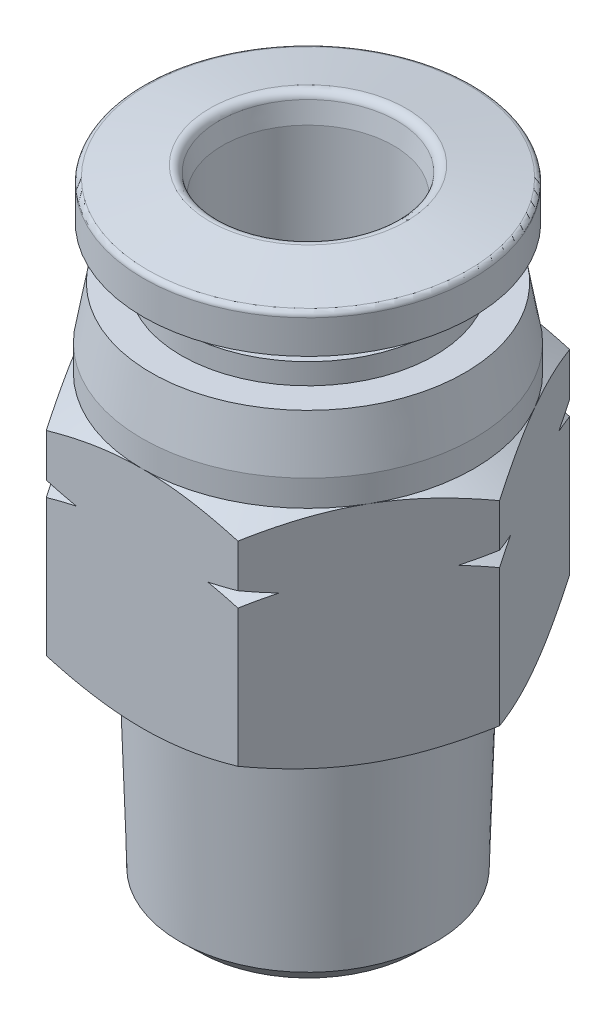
ISO-10303-21;
HEADER;
FILE_DESCRIPTION(('STEP AP214'),'2;1');
FILE_NAME('part.step','',(''),(''),'','','');
FILE_SCHEMA(('AUTOMOTIVE_DESIGN { 1 0 10303 214 1 1 1 1 }'));
ENDSEC;
DATA;
#1=APPLICATION_CONTEXT('core data for automotive mechanical design processes');
#2=APPLICATION_PROTOCOL_DEFINITION('international standard','automotive_design',2000,#1);
#3=PRODUCT_CONTEXT('',#1,'mechanical');
#4=PRODUCT('Part','Part','',(#3));
#5=PRODUCT_RELATED_PRODUCT_CATEGORY('part','',(#4));
#6=PRODUCT_DEFINITION_FORMATION('','',#4);
#7=PRODUCT_DEFINITION_CONTEXT('part definition',#1,'design');
#8=PRODUCT_DEFINITION('design','',#6,#7);
#9=PRODUCT_DEFINITION_SHAPE('','',#8);
#10=(LENGTH_UNIT() NAMED_UNIT(*) SI_UNIT(.MILLI.,.METRE.));
#11=(NAMED_UNIT(*) PLANE_ANGLE_UNIT() SI_UNIT($,.RADIAN.));
#12=(NAMED_UNIT(*) SI_UNIT($,.STERADIAN.) SOLID_ANGLE_UNIT());
#13=UNCERTAINTY_MEASURE_WITH_UNIT(LENGTH_MEASURE(1.E-05),#10,'distance_accuracy_value','');
#14=(GEOMETRIC_REPRESENTATION_CONTEXT(3) GLOBAL_UNCERTAINTY_ASSIGNED_CONTEXT((#13)) GLOBAL_UNIT_ASSIGNED_CONTEXT((#10,
#11,#12)) REPRESENTATION_CONTEXT('',''));
#15=CARTESIAN_POINT('',(0.,0.,0.));
#16=DIRECTION('',(0.,0.,1.));
#17=DIRECTION('',(1.,0.,0.));
#18=AXIS2_PLACEMENT_3D('',#15,#16,#17);
#19=CARTESIAN_POINT('',(0.,18.1000000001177,0.));
#20=DIRECTION('',(0.,-1.,0.));
#21=DIRECTION('',(0.,0.,-1.));
#22=AXIS2_PLACEMENT_3D('',#19,#20,#21);
#23=CONICAL_SURFACE('',#22,6.34999999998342,0.173245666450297);
#24=CARTESIAN_POINT('',(0.,18.1000000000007,0.));
#25=DIRECTION('',(0.,1.,0.));
#26=DIRECTION('',(0.,0.,1.));
#27=AXIS2_PLACEMENT_3D('',#24,#25,#26);
#28=CIRCLE('',#27,6.35000000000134);
#29=CARTESIAN_POINT('',(0.,18.1000000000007,6.35000000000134));
#30=VERTEX_POINT('',#29);
#31=EDGE_CURVE('E509',#30,#30,#28,.F.);
#32=ORIENTED_EDGE('',*,*,#31,.F.);
#33=EDGE_LOOP('',(#32));
#34=FACE_BOUND('',#33,.T.);
#35=CARTESIAN_POINT('',(0.,20.1000000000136,0.));
#36=DIRECTION('',(0.,-1.,0.));
#37=DIRECTION('',(0.,0.,-1.));
#38=AXIS2_PLACEMENT_3D('',#35,#36,#37);
#39=CIRCLE('',#38,6.00000000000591);
#40=CARTESIAN_POINT('',(0.,20.1000000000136,-6.00000000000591));
#41=VERTEX_POINT('',#40);
#42=EDGE_CURVE('E20',#41,#41,#39,.F.);
#43=ORIENTED_EDGE('',*,*,#42,.F.);
#44=EDGE_LOOP('',(#43));
#45=FACE_BOUND('',#44,.T.);
#46=ADVANCED_FACE('F17',(#34,#45),#23,.T.);
#47=CARTESIAN_POINT('',(-5.42500000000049,20.0999999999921,0.));
#48=DIRECTION('',(0.,1.,0.));
#49=DIRECTION('',(0.,0.,1.));
#50=AXIS2_PLACEMENT_3D('',#47,#48,#49);
#51=PLANE('',#50);
#52=CARTESIAN_POINT('',(0.,20.0999999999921,0.));
#53=DIRECTION('',(0.,1.,0.));
#54=DIRECTION('',(0.,0.,1.));
#55=AXIS2_PLACEMENT_3D('',#52,#53,#54);
#56=CIRCLE('',#55,4.85);
#57=CARTESIAN_POINT('',(0.,20.0999999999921,4.85));
#58=VERTEX_POINT('',#57);
#59=EDGE_CURVE('E192',#58,#58,#56,.T.);
#60=ORIENTED_EDGE('',*,*,#59,.F.);
#61=EDGE_LOOP('',(#60));
#62=FACE_BOUND('',#61,.T.);
#63=ORIENTED_EDGE('',*,*,#42,.T.);
#64=EDGE_LOOP('',(#63));
#65=FACE_BOUND('',#64,.T.);
#66=ADVANCED_FACE('F318',(#62,#65),#51,.T.);
#67=CARTESIAN_POINT('',(0.,14.8904071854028,0.));
#68=DIRECTION('',(0.,1.,0.));
#69=DIRECTION('',(0.,0.,1.));
#70=AXIS2_PLACEMENT_3D('',#67,#68,#69);
#71=CONICAL_SURFACE('',#70,7.33534841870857,1.04719755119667);
#72=CARTESIAN_POINT('',(-3.66617423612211,14.8886751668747,-6.34999996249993));
#73=CARTESIAN_POINT('',(-3.57163329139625,14.8613841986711,-6.34999998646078));
#74=CARTESIAN_POINT('',(-3.47687988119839,14.8348223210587,-6.349999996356));
#75=CARTESIAN_POINT('',(-3.28697569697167,14.7832825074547,-6.35000000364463));
#76=CARTESIAN_POINT('',(-3.1918250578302,14.7583040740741,-6.350000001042));
#77=CARTESIAN_POINT('',(-3.00109116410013,14.7100387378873,-6.34999999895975));
#78=CARTESIAN_POINT('',(-2.90550789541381,14.686751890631,-6.34999999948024));
#79=CARTESIAN_POINT('',(-2.71388741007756,14.6419864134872,-6.35000000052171));
#80=CARTESIAN_POINT('',(-2.61785005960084,14.6205083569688,-6.35000000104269));
#81=CARTESIAN_POINT('',(-2.52160363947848,14.600000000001,-6.35000000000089));
#82=B_SPLINE_CURVE_WITH_KNOTS('',3,(#72,#73,#74,#75,#76,#77,#78,#79,#80,#81),.UNSPECIFIED.,.F.,
.F.,(4,2,2,2,4),(0.,0.295203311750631,0.590313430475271,0.885433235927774,1.18064624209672),.UNSPECIFIED.);
#83=CARTESIAN_POINT('',(-3.66617423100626,14.8886751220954,-6.34999996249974));
#84=VERTEX_POINT('',#83);
#85=CARTESIAN_POINT('',(-2.52160363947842,14.600000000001,-6.35000000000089));
#86=VERTEX_POINT('',#85);
#87=EDGE_CURVE('E185',#84,#86,#82,.T.);
#88=ORIENTED_EDGE('',*,*,#87,.T.);
#89=CARTESIAN_POINT('',(0.,14.6000000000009,0.));
#90=DIRECTION('',(0.,-1.,0.));
#91=DIRECTION('',(-1.,0.,0.));
#92=AXIS2_PLACEMENT_3D('',#89,#90,#91);
#93=CIRCLE('',#92,6.83234841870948);
#94=CARTESIAN_POINT('',(-4.23845949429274,14.600000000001,-5.35877281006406));
#95=VERTEX_POINT('',#94);
#96=EDGE_CURVE('E187',#95,#86,#93,.T.);
#97=ORIENTED_EDGE('',*,*,#96,.F.);
#98=CARTESIAN_POINT('',(-4.23845949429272,14.600000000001,-5.35877281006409));
#99=CARTESIAN_POINT('',(-4.19033628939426,14.6205083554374,-5.44212464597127));
#100=CARTESIAN_POINT('',(-4.14231761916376,14.6419864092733,-5.5252954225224));
#101=CARTESIAN_POINT('',(-4.04650738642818,14.6867518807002,-5.69124361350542));
#102=CARTESIAN_POINT('',(-3.99871575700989,14.7100387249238,-5.7740211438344));
#103=CARTESIAN_POINT('',(-3.9033488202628,14.7583040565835,-5.93920152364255));
#104=CARTESIAN_POINT('',(-3.85577350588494,14.7832824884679,-6.02160438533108));
#105=CARTESIAN_POINT('',(-3.76082142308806,14.8348222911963,-6.18606621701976));
#106=CARTESIAN_POINT('',(-3.71344472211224,14.8613841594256,-6.26812507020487));
#107=CARTESIAN_POINT('',(-3.66617425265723,14.8886751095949,-6.34999992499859));
#108=B_SPLINE_CURVE_WITH_KNOTS('',3,(#98,#99,#100,#101,#102,#103,#104,#105,#106,#107),
.UNSPECIFIED.,.F.,.F.,(4,2,2,2,4),(0.,0.295212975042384,0.590332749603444,0.885442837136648,
1.18064611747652),.UNSPECIFIED.);
#109=EDGE_CURVE('E175',#95,#84,#108,.T.);
#110=ORIENTED_EDGE('',*,*,#109,.T.);
#111=EDGE_LOOP('',(#88,#97,#110));
#112=FACE_BOUND('',#111,.T.);
#113=ADVANCED_FACE('F188',(#112),#71,.T.);
#114=CARTESIAN_POINT('',(0.,14.3095928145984,0.));
#115=DIRECTION('',(0.,-1.,0.));
#116=DIRECTION('',(0.,0.,-1.));
#117=AXIS2_PLACEMENT_3D('',#114,#115,#116);
#118=CONICAL_SURFACE('',#117,7.3353484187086,1.04719755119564);
#119=CARTESIAN_POINT('',(0.,14.600000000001,0.));
#120=DIRECTION('',(0.,1.,0.));
#121=DIRECTION('',(-1.,0.,0.));
#122=AXIS2_PLACEMENT_3D('',#119,#120,#121);
#123=CIRCLE('',#122,6.83234841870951);
#124=CARTESIAN_POINT('',(4.23845949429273,14.600000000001,-5.35877281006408));
#125=VERTEX_POINT('',#124);
#126=CARTESIAN_POINT('',(2.52160363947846,14.600000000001,-6.35000000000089));
#127=VERTEX_POINT('',#126);
#128=EDGE_CURVE('E505',#125,#127,#123,.T.);
#129=ORIENTED_EDGE('',*,*,#128,.F.);
#130=CARTESIAN_POINT('',(4.23845949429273,14.6000000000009,-5.35877281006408));
#131=CARTESIAN_POINT('',(4.19033628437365,14.5794916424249,-5.44212465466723));
#132=CARTESIAN_POINT('',(4.14231760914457,14.5580135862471,-5.52529543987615));
#133=CARTESIAN_POINT('',(4.04650736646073,14.5132481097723,-5.69124364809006));
#134=CARTESIAN_POINT('',(3.99871573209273,14.4899612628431,-5.77402118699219));
#135=CARTESIAN_POINT('',(3.90334878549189,14.4416959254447,-5.93920158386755));
#136=CARTESIAN_POINT('',(3.85577346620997,14.4167174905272,-6.02160445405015));
#137=CARTESIAN_POINT('',(3.76082137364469,14.3651776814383,-6.1860663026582));
#138=CARTESIAN_POINT('',(3.71344466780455,14.3386158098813,-6.26812516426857));
#139=CARTESIAN_POINT('',(3.66617419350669,14.3113248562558,-6.35000002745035));
#140=B_SPLINE_CURVE_WITH_KNOTS('',3,(#130,#131,#132,#133,#134,#135,#136,#137,#138,#139),
.UNSPECIFIED.,.F.,.F.,(4,2,2,2,4),(0.,0.295213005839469,0.590332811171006,0.885442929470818,
1.1806462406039),.UNSPECIFIED.);
#141=CARTESIAN_POINT('',(3.66617420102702,14.3113248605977,-6.35000001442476));
#142=VERTEX_POINT('',#141);
#143=EDGE_CURVE('E298',#125,#142,#140,.T.);
#144=ORIENTED_EDGE('',*,*,#143,.T.);
#145=CARTESIAN_POINT('',(3.66617412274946,14.3113248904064,-6.35000000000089));
#146=CARTESIAN_POINT('',(3.57163318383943,14.3386158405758,-6.35000000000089));
#147=CARTESIAN_POINT('',(3.47687978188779,14.3651777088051,-6.35000000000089));
#148=CARTESIAN_POINT('',(3.28697561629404,14.4167175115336,-6.35000000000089));
#149=CARTESIAN_POINT('',(3.19182498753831,14.4416959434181,-6.35000000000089));
#150=CARTESIAN_POINT('',(3.00109111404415,14.4899612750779,-6.35000000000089));
#151=CARTESIAN_POINT('',(2.90550785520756,14.5132481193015,-6.35000000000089));
#152=CARTESIAN_POINT('',(2.7138873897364,14.5580135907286,-6.35000000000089));
#153=CARTESIAN_POINT('',(2.61785004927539,14.5794916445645,-6.35000000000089));
#154=CARTESIAN_POINT('',(2.52160363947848,14.600000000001,-6.35000000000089));
#155=B_SPLINE_CURVE_WITH_KNOTS('',3,(#145,#146,#147,#148,#149,#150,#151,#152,#153,#154),
.UNSPECIFIED.,.F.,.F.,(4,2,2,2,4),(0.,0.295203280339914,0.590313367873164,0.885433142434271,
1.1806461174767),.UNSPECIFIED.);
#156=EDGE_CURVE('E292',#142,#127,#155,.T.);
#157=ORIENTED_EDGE('',*,*,#156,.T.);
#158=EDGE_LOOP('',(#129,#144,#157));
#159=FACE_BOUND('',#158,.T.);
#160=ADVANCED_FACE('F307',(#159),#118,.T.);
#161=CARTESIAN_POINT('',(0.,14.3095928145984,0.));
#162=DIRECTION('',(0.,-1.,0.));
#163=DIRECTION('',(0.,0.,-1.));
#164=AXIS2_PLACEMENT_3D('',#161,#162,#163);
#165=CONICAL_SURFACE('',#164,7.3353484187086,1.04719755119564);
#166=CARTESIAN_POINT('',(0.,14.600000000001,0.));
#167=DIRECTION('',(0.,1.,0.));
#168=DIRECTION('',(-1.,0.,0.));
#169=AXIS2_PLACEMENT_3D('',#166,#167,#168);
#170=CIRCLE('',#169,6.8323484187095);
#171=CARTESIAN_POINT('',(6.76006313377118,14.600000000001,0.991227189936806));
#172=VERTEX_POINT('',#171);
#173=CARTESIAN_POINT('',(6.76006313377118,14.600000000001,-0.991227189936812));
#174=VERTEX_POINT('',#173);
#175=EDGE_CURVE('E500',#172,#174,#170,.T.);
#176=ORIENTED_EDGE('',*,*,#175,.F.);
#177=CARTESIAN_POINT('',(6.76006313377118,14.6000000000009,0.991227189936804));
#178=CARTESIAN_POINT('',(6.80818634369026,14.5794916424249,0.907875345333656));
#179=CARTESIAN_POINT('',(6.85620501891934,14.5580135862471,0.824704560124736));
#180=CARTESIAN_POINT('',(6.95201526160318,14.5132481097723,0.658756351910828));
#181=CARTESIAN_POINT('',(6.99980689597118,14.4899612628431,0.575978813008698));
#182=CARTESIAN_POINT('',(7.09517384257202,14.4416959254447,0.410798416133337));
#183=CARTESIAN_POINT('',(7.14274916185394,14.4167174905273,0.32839554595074));
#184=CARTESIAN_POINT('',(7.23770125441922,14.3651776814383,0.163933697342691));
#185=CARTESIAN_POINT('',(7.28507796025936,14.3386158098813,0.0818748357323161));
#186=CARTESIAN_POINT('',(7.33234843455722,14.3113248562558,-2.7449460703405E-08));
#187=B_SPLINE_CURVE_WITH_KNOTS('',3,(#177,#178,#179,#180,#181,#182,#183,#184,#185,#186),
.UNSPECIFIED.,.F.,.F.,(4,2,2,2,4),(0.,0.295213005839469,0.590332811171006,0.885442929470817,
1.1806462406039),.UNSPECIFIED.);
#188=CARTESIAN_POINT('',(7.33234842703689,14.3113248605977,-1.44238681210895E-08));
#189=VERTEX_POINT('',#188);
#190=EDGE_CURVE('E807',#172,#189,#187,.T.);
#191=ORIENTED_EDGE('',*,*,#190,.T.);
#192=CARTESIAN_POINT('',(7.33234837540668,14.3113248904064,-7.5002288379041E-08));
#193=CARTESIAN_POINT('',(7.28507790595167,14.3386158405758,-0.0818749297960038));
#194=CARTESIAN_POINT('',(7.23770120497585,14.3651777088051,-0.16393378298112));
#195=CARTESIAN_POINT('',(7.14274912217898,14.4167175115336,-0.328395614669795));
#196=CARTESIAN_POINT('',(7.09517380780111,14.4416959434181,-0.410798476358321));
#197=CARTESIAN_POINT('',(6.99980687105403,14.4899612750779,-0.575978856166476));
#198=CARTESIAN_POINT('',(6.95201524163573,14.5132481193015,-0.658756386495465));
#199=CARTESIAN_POINT('',(6.85620500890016,14.5580135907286,-0.824704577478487));
#200=CARTESIAN_POINT('',(6.80818633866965,14.5794916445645,-0.907875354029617));
#201=CARTESIAN_POINT('',(6.76006313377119,14.600000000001,-0.99122718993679));
#202=B_SPLINE_CURVE_WITH_KNOTS('',3,(#192,#193,#194,#195,#196,#197,#198,#199,#200,#201),
.UNSPECIFIED.,.F.,.F.,(4,2,2,2,4),(0.,0.295203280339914,0.590313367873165,0.885433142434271,
1.1806461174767),.UNSPECIFIED.);
#203=EDGE_CURVE('E808',#189,#174,#202,.T.);
#204=ORIENTED_EDGE('',*,*,#203,.T.);
#205=EDGE_LOOP('',(#176,#191,#204));
#206=FACE_BOUND('',#205,.T.);
#207=ADVANCED_FACE('F311',(#206),#165,.T.);
#208=CARTESIAN_POINT('',(0.,14.3095928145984,0.));
#209=DIRECTION('',(0.,-1.,0.));
#210=DIRECTION('',(0.,0.,-1.));
#211=AXIS2_PLACEMENT_3D('',#208,#209,#210);
#212=CONICAL_SURFACE('',#211,7.3353484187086,1.04719755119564);
#213=CARTESIAN_POINT('',(3.66617416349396,14.3113248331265,6.35000000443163));
#214=CARTESIAN_POINT('',(3.71344465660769,14.3386158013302,6.26812515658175));
#215=CARTESIAN_POINT('',(3.76082137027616,14.3651776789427,6.18606630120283));
#216=CARTESIAN_POINT('',(3.85577346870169,14.4167174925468,6.02160445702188));
#217=CARTESIAN_POINT('',(3.90334878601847,14.4416959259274,5.93920158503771));
#218=CARTESIAN_POINT('',(3.99871573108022,14.4899612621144,5.77402118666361));
#219=CARTESIAN_POINT('',(4.04650736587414,14.5132481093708,5.69124364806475));
#220=CARTESIAN_POINT('',(4.14231760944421,14.5580135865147,5.52529544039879));
#221=CARTESIAN_POINT('',(4.19033628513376,14.5794916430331,5.44212465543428));
#222=CARTESIAN_POINT('',(4.23845949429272,14.600000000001,5.3587728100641));
#223=B_SPLINE_CURVE_WITH_KNOTS('',3,(#213,#214,#215,#216,#217,#218,#219,#220,#221,#222),
.UNSPECIFIED.,.F.,.F.,(4,2,2,2,4),(0.,0.295203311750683,0.590313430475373,0.885433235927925,
1.18064624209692),.UNSPECIFIED.);
#224=CARTESIAN_POINT('',(3.66617416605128,14.3113248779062,6.35000000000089));
#225=VERTEX_POINT('',#224);
#226=CARTESIAN_POINT('',(4.23845949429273,14.600000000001,5.35877281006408));
#227=VERTEX_POINT('',#226);
#228=EDGE_CURVE('E631',#225,#227,#223,.T.);
#229=ORIENTED_EDGE('',*,*,#228,.T.);
#230=CARTESIAN_POINT('',(0.,14.600000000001,0.));
#231=DIRECTION('',(0.,1.,0.));
#232=DIRECTION('',(-1.,0.,0.));
#233=AXIS2_PLACEMENT_3D('',#230,#231,#232);
#234=CIRCLE('',#233,6.8323484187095);
#235=CARTESIAN_POINT('',(2.52160363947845,14.600000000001,6.35000000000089));
#236=VERTEX_POINT('',#235);
#237=EDGE_CURVE('E495',#236,#227,#234,.T.);
#238=ORIENTED_EDGE('',*,*,#237,.F.);
#239=CARTESIAN_POINT('',(2.52160363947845,14.6000000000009,6.35000000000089));
#240=CARTESIAN_POINT('',(2.61785004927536,14.5794916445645,6.35000000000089));
#241=CARTESIAN_POINT('',(2.71388738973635,14.5580135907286,6.35000000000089));
#242=CARTESIAN_POINT('',(2.90550785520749,14.5132481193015,6.35000000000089));
#243=CARTESIAN_POINT('',(3.00109111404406,14.4899612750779,6.35000000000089));
#244=CARTESIAN_POINT('',(3.19182498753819,14.4416959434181,6.35000000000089));
#245=CARTESIAN_POINT('',(3.28697561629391,14.4167175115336,6.35000000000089));
#246=CARTESIAN_POINT('',(3.47687978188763,14.3651777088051,6.35000000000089));
#247=CARTESIAN_POINT('',(3.57163318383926,14.3386158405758,6.35000000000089));
#248=CARTESIAN_POINT('',(3.66617412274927,14.3113248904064,6.35000000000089));
#249=B_SPLINE_CURVE_WITH_KNOTS('',3,(#239,#240,#241,#242,#243,#244,#245,#246,#247,#248),
.UNSPECIFIED.,.F.,.F.,(4,2,2,2,4),(0.,0.295212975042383,0.590332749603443,0.885442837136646,
1.18064611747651),.UNSPECIFIED.);
#250=EDGE_CURVE('E636',#236,#225,#249,.T.);
#251=ORIENTED_EDGE('',*,*,#250,.T.);
#252=EDGE_LOOP('',(#229,#238,#251));
#253=FACE_BOUND('',#252,.T.);
#254=ADVANCED_FACE('F622',(#253),#212,.T.);
#255=CARTESIAN_POINT('',(0.,14.8904071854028,0.));
#256=DIRECTION('',(0.,1.,0.));
#257=DIRECTION('',(0.,0.,1.));
#258=AXIS2_PLACEMENT_3D('',#255,#256,#257);
#259=CONICAL_SURFACE('',#258,7.33534841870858,1.04719755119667);
#260=CARTESIAN_POINT('',(-3.66617416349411,14.8886751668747,6.35000000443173));
#261=CARTESIAN_POINT('',(-3.71344465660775,14.8613841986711,6.26812515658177));
#262=CARTESIAN_POINT('',(-3.76082137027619,14.8348223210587,6.18606630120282));
#263=CARTESIAN_POINT('',(-3.85577346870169,14.7832825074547,6.02160445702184));
#264=CARTESIAN_POINT('',(-3.90334878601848,14.7583040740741,5.93920158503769));
#265=CARTESIAN_POINT('',(-3.99871573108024,14.7100387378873,5.77402118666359));
#266=CARTESIAN_POINT('',(-4.04650736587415,14.6867518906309,5.69124364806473));
#267=CARTESIAN_POINT('',(-4.14231760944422,14.6419864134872,5.52529544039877));
#268=CARTESIAN_POINT('',(-4.19033628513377,14.6205083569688,5.44212465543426));
#269=CARTESIAN_POINT('',(-4.23845949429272,14.600000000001,5.35877281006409));
#270=B_SPLINE_CURVE_WITH_KNOTS('',3,(#260,#261,#262,#263,#264,#265,#266,#267,#268,#269),
.UNSPECIFIED.,.F.,.F.,(4,2,2,2,4),(0.,0.295203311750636,0.590313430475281,0.885433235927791,
1.18064624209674),.UNSPECIFIED.);
#271=CARTESIAN_POINT('',(-3.66617416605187,14.8886751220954,6.35000000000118));
#272=VERTEX_POINT('',#271);
#273=CARTESIAN_POINT('',(-4.23845949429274,14.600000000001,5.35877281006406));
#274=VERTEX_POINT('',#273);
#275=EDGE_CURVE('E604',#272,#274,#270,.T.);
#276=ORIENTED_EDGE('',*,*,#275,.T.);
#277=CARTESIAN_POINT('',(0.,14.6000000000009,0.));
#278=DIRECTION('',(0.,-1.,0.));
#279=DIRECTION('',(-1.,0.,0.));
#280=AXIS2_PLACEMENT_3D('',#277,#278,#279);
#281=CIRCLE('',#280,6.83234841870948);
#282=CARTESIAN_POINT('',(-2.52160363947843,14.600000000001,6.35000000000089));
#283=VERTEX_POINT('',#282);
#284=EDGE_CURVE('E490',#283,#274,#281,.T.);
#285=ORIENTED_EDGE('',*,*,#284,.F.);
#286=CARTESIAN_POINT('',(-2.52160363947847,14.600000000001,6.35000000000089));
#287=CARTESIAN_POINT('',(-2.61785004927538,14.6205083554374,6.35000000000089));
#288=CARTESIAN_POINT('',(-2.71388738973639,14.6419864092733,6.35000000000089));
#289=CARTESIAN_POINT('',(-2.90550785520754,14.6867518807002,6.35000000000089));
#290=CARTESIAN_POINT('',(-3.00109111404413,14.7100387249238,6.35000000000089));
#291=CARTESIAN_POINT('',(-3.19182498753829,14.7583040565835,6.35000000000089));
#292=CARTESIAN_POINT('',(-3.28697561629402,14.7832824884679,6.35000000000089));
#293=CARTESIAN_POINT('',(-3.47687978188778,14.8348222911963,6.35000000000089));
#294=CARTESIAN_POINT('',(-3.57163318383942,14.8613841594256,6.35000000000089));
#295=CARTESIAN_POINT('',(-3.66617412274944,14.8886751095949,6.35000000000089));
#296=B_SPLINE_CURVE_WITH_KNOTS('',3,(#286,#287,#288,#289,#290,#291,#292,#293,#294,#295),
.UNSPECIFIED.,.F.,.F.,(4,2,2,2,4),(0.,0.295212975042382,0.590332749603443,0.885442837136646,
1.18064611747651),.UNSPECIFIED.);
#297=EDGE_CURVE('E626',#283,#272,#296,.T.);
#298=ORIENTED_EDGE('',*,*,#297,.T.);
#299=EDGE_LOOP('',(#276,#285,#298));
#300=FACE_BOUND('',#299,.T.);
#301=ADVANCED_FACE('F617',(#300),#259,.T.);
#302=CARTESIAN_POINT('',(0.,14.8904071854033,0.));
#303=DIRECTION('',(0.,1.,0.));
#304=DIRECTION('',(0.,0.,1.));
#305=AXIS2_PLACEMENT_3D('',#302,#303,#304);
#306=CONICAL_SURFACE('',#305,7.33534841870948,1.04719755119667);
#307=CARTESIAN_POINT('',(-7.33234843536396,14.8886751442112,2.88467594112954E-08));
#308=CARTESIAN_POINT('',(-7.28507796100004,14.8613841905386,-0.0818748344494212));
#309=CARTESIAN_POINT('',(-7.23770125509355,14.8348223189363,-0.163933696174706));
#310=CARTESIAN_POINT('',(-7.14274916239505,14.7832825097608,-0.328395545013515));
#311=CARTESIAN_POINT('',(-7.09517384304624,14.758304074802,-0.410798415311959));
#312=CARTESIAN_POINT('',(-6.99980689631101,14.7100387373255,-0.575978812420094));
#313=CARTESIAN_POINT('',(-6.9520152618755,14.6867518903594,-0.658756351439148));
#314=CARTESIAN_POINT('',(-6.85620501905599,14.6419864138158,-0.824704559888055));
#315=CARTESIAN_POINT('',(-6.80818634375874,14.6205083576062,-0.90787534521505));
#316=CARTESIAN_POINT('',(-6.76006313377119,14.600000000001,-0.991227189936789));
#317=B_SPLINE_CURVE_WITH_KNOTS('',3,(#307,#308,#309,#310,#311,#312,#313,#314,#315,#316),
.UNSPECIFIED.,.F.,.F.,(4,2,2,2,4),(0.,0.295203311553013,0.590313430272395,0.885433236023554,
1.18064624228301),.UNSPECIFIED.);
#318=CARTESIAN_POINT('',(-7.33234839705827,14.8886751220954,3.75006276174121E-08));
#319=VERTEX_POINT('',#318);
#320=CARTESIAN_POINT('',(-6.76006313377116,14.600000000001,-0.991227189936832));
#321=VERTEX_POINT('',#320);
#322=EDGE_CURVE('E512',#319,#321,#317,.T.);
#323=ORIENTED_EDGE('',*,*,#322,.T.);
#324=CARTESIAN_POINT('',(0.,14.6000000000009,0.));
#325=DIRECTION('',(0.,-1.,0.));
#326=DIRECTION('',(-1.,0.,0.));
#327=AXIS2_PLACEMENT_3D('',#324,#325,#326);
#328=CIRCLE('',#327,6.83234841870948);
#329=CARTESIAN_POINT('',(-6.76006313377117,14.600000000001,0.99122718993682));
#330=VERTEX_POINT('',#329);
#331=EDGE_CURVE('E487',#330,#321,#328,.T.);
#332=ORIENTED_EDGE('',*,*,#331,.F.);
#333=CARTESIAN_POINT('',(-6.76006313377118,14.600000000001,0.991227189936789));
#334=CARTESIAN_POINT('',(-6.80818633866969,14.6205083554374,0.907875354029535));
#335=CARTESIAN_POINT('',(-6.85620500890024,14.6419864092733,0.824704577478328));
#336=CARTESIAN_POINT('',(-6.9520152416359,14.6867518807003,0.658756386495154));
#337=CARTESIAN_POINT('',(-6.99980687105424,14.7100387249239,0.57597885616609));
#338=CARTESIAN_POINT('',(-7.09517380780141,14.7583040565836,0.410798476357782));
#339=CARTESIAN_POINT('',(-7.14274912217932,14.7832824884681,0.32839561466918));
#340=CARTESIAN_POINT('',(-7.23770120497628,14.8348222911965,0.16393378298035));
#341=CARTESIAN_POINT('',(-7.28507790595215,14.8613841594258,0.0818749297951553));
#342=CARTESIAN_POINT('',(-7.33234837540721,14.8886751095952,7.50013614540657E-08));
#343=B_SPLINE_CURVE_WITH_KNOTS('',3,(#333,#334,#335,#336,#337,#338,#339,#340,#341,#342),
.UNSPECIFIED.,.F.,.F.,(4,2,2,2,4),(0.,0.295212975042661,0.590332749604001,0.885442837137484,
1.18064611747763),.UNSPECIFIED.);
#344=EDGE_CURVE('E599',#330,#319,#343,.T.);
#345=ORIENTED_EDGE('',*,*,#344,.T.);
#346=EDGE_LOOP('',(#323,#332,#345));
#347=FACE_BOUND('',#346,.T.);
#348=ADVANCED_FACE('F613',(#347),#306,.T.);
#349=CARTESIAN_POINT('',(0.,17.6000000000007,0.));
#350=DIRECTION('',(0.,1.,0.));
#351=DIRECTION('',(0.,0.,1.));
#352=AXIS2_PLACEMENT_3D('',#349,#350,#351);
#353=CYLINDRICAL_SURFACE('',#352,6.35000000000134);
#354=CARTESIAN_POINT('',(0.,17.0999999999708,0.));
#355=DIRECTION('',(0.,-1.,0.));
#356=DIRECTION('',(-1.,0.,0.));
#357=AXIS2_PLACEMENT_3D('',#354,#355,#356);
#358=CIRCLE('',#357,6.34999999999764);
#359=CARTESIAN_POINT('',(0.,17.0999999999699,-6.34999999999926));
#360=VERTEX_POINT('',#359);
#361=CARTESIAN_POINT('',(5.49926131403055,17.0999999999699,-3.17499999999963));
#362=VERTEX_POINT('',#361);
#363=EDGE_CURVE('E503',#360,#362,#358,.T.);
#364=ORIENTED_EDGE('',*,*,#363,.F.);
#365=CARTESIAN_POINT('',(0.,17.0999999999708,0.));
#366=DIRECTION('',(0.,-1.,0.));
#367=DIRECTION('',(-1.,0.,0.));
#368=AXIS2_PLACEMENT_3D('',#365,#366,#367);
#369=CIRCLE('',#368,6.34999999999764);
#370=CARTESIAN_POINT('',(-5.49926131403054,17.0999999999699,-3.17499999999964));
#371=VERTEX_POINT('',#370);
#372=EDGE_CURVE('E233',#371,#360,#369,.T.);
#373=ORIENTED_EDGE('',*,*,#372,.F.);
#374=CARTESIAN_POINT('',(0.,17.0999999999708,0.));
#375=DIRECTION('',(0.,-1.,0.));
#376=DIRECTION('',(-1.,0.,0.));
#377=AXIS2_PLACEMENT_3D('',#374,#375,#376);
#378=CIRCLE('',#377,6.34999999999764);
#379=CARTESIAN_POINT('',(-5.49926131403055,17.0999999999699,3.17499999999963));
#380=VERTEX_POINT('',#379);
#381=EDGE_CURVE('E202',#380,#371,#378,.T.);
#382=ORIENTED_EDGE('',*,*,#381,.F.);
#383=CARTESIAN_POINT('',(0.,17.0999999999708,0.));
#384=DIRECTION('',(0.,-1.,0.));
#385=DIRECTION('',(-1.,0.,0.));
#386=AXIS2_PLACEMENT_3D('',#383,#384,#385);
#387=CIRCLE('',#386,6.34999999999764);
#388=CARTESIAN_POINT('',(0.,17.0999999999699,6.34999999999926));
#389=VERTEX_POINT('',#388);
#390=EDGE_CURVE('E485',#389,#380,#387,.T.);
#391=ORIENTED_EDGE('',*,*,#390,.F.);
#392=CARTESIAN_POINT('',(0.,17.0999999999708,0.));
#393=DIRECTION('',(0.,-1.,0.));
#394=DIRECTION('',(-1.,0.,0.));
#395=AXIS2_PLACEMENT_3D('',#392,#393,#394);
#396=CIRCLE('',#395,6.34999999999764);
#397=CARTESIAN_POINT('',(5.49926131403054,17.0999999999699,3.17499999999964));
#398=VERTEX_POINT('',#397);
#399=EDGE_CURVE('E493',#398,#389,#396,.T.);
#400=ORIENTED_EDGE('',*,*,#399,.F.);
#401=CARTESIAN_POINT('',(0.,17.0999999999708,0.));
#402=DIRECTION('',(0.,-1.,0.));
#403=DIRECTION('',(-1.,0.,0.));
#404=AXIS2_PLACEMENT_3D('',#401,#402,#403);
#405=CIRCLE('',#404,6.34999999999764);
#406=EDGE_CURVE('E498',#362,#398,#405,.T.);
#407=ORIENTED_EDGE('',*,*,#406,.F.);
#408=EDGE_LOOP('',(#364,#373,#382,#391,#400,#407));
#409=FACE_BOUND('',#408,.T.);
#410=ORIENTED_EDGE('',*,*,#31,.T.);
#411=EDGE_LOOP('',(#410));
#412=FACE_BOUND('',#411,.T.);
#413=ADVANCED_FACE('F616',(#409,#412),#353,.T.);
#414=CARTESIAN_POINT('',(0.,20.4999999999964,0.));
#415=DIRECTION('',(0.,1.,0.));
#416=DIRECTION('',(0.,0.,1.));
#417=AXIS2_PLACEMENT_3D('',#414,#415,#416);
#418=CYLINDRICAL_SURFACE('',#417,4.85);
#419=ORIENTED_EDGE('',*,*,#59,.T.);
#420=EDGE_LOOP('',(#419));
#421=FACE_BOUND('',#420,.T.);
#422=CARTESIAN_POINT('',(0.,20.9000000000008,0.));
#423=DIRECTION('',(0.,1.,0.));
#424=DIRECTION('',(0.,0.,1.));
#425=AXIS2_PLACEMENT_3D('',#422,#423,#424);
#426=CIRCLE('',#425,4.85);
#427=CARTESIAN_POINT('',(0.,20.9000000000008,4.85));
#428=VERTEX_POINT('',#427);
#429=EDGE_CURVE('E196',#428,#428,#426,.T.);
#430=ORIENTED_EDGE('',*,*,#429,.F.);
#431=EDGE_LOOP('',(#430));
#432=FACE_BOUND('',#431,.T.);
#433=ADVANCED_FACE('F223',(#421,#432),#418,.T.);
#434=CARTESIAN_POINT('',(0.,14.3095928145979,0.));
#435=DIRECTION('',(0.,-1.,0.));
#436=DIRECTION('',(0.,0.,-1.));
#437=AXIS2_PLACEMENT_3D('',#434,#435,#436);
#438=CONICAL_SURFACE('',#437,7.33534841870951,1.04719755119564);
#439=ORIENTED_EDGE('',*,*,#96,.T.);
#440=CARTESIAN_POINT('',(-2.52160363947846,14.6000000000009,-6.35000000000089));
#441=CARTESIAN_POINT('',(-2.61785005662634,14.5794916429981,-6.35000000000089));
#442=CARTESIAN_POINT('',(-2.71388740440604,14.5580135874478,-6.35000000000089));
#443=CARTESIAN_POINT('',(-2.90550788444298,14.5132481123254,-6.35000000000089));
#444=CARTESIAN_POINT('',(-3.0010911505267,14.489961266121,-6.35000000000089));
#445=CARTESIAN_POINT('',(-3.19182503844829,14.4416959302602,-6.35000000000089));
#446=CARTESIAN_POINT('',(-3.28697567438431,14.4167174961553,-6.35000000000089));
#447=CARTESIAN_POINT('',(-3.47687985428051,14.3651776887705,-6.35000000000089));
#448=CARTESIAN_POINT('',(-3.57163326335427,14.3386158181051,-6.35000000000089));
#449=CARTESIAN_POINT('',(-3.66617420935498,14.3113248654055,-6.35000000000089));
#450=B_SPLINE_CURVE_WITH_KNOTS('',3,(#440,#441,#442,#443,#444,#445,#446,#447,#448,#449),
.UNSPECIFIED.,.F.,.F.,(4,2,2,2,4),(0.,0.295212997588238,0.590332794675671,0.885442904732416,
1.1806462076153),.UNSPECIFIED.);
#451=CARTESIAN_POINT('',(-3.66617420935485,14.3113248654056,-6.3500000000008));
#452=VERTEX_POINT('',#451);
#453=EDGE_CURVE('E191',#86,#452,#450,.T.);
#454=ORIENTED_EDGE('',*,*,#453,.T.);
#455=CARTESIAN_POINT('',(-4.23845949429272,14.6000000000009,-5.35877281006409));
#456=CARTESIAN_POINT('',(-4.1903362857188,14.5794916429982,-5.44212465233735));
#457=CARTESIAN_POINT('',(-4.14231761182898,14.5580135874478,-5.52529543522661));
#458=CARTESIAN_POINT('',(-4.04650737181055,14.5132481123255,-5.69124363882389));
#459=CARTESIAN_POINT('',(-3.99871573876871,14.4899612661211,-5.77402117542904));
#460=CARTESIAN_POINT('',(-3.90334879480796,14.4416959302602,-5.93920156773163));
#461=CARTESIAN_POINT('',(-3.85577347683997,14.4167174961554,-6.02160443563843));
#462=CARTESIAN_POINT('',(-3.76082138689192,14.3651776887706,-6.18606627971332));
#463=CARTESIAN_POINT('',(-3.71344468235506,14.3386158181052,-6.26812513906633));
#464=CARTESIAN_POINT('',(-3.66617420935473,14.3113248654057,-6.35000000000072));
#465=B_SPLINE_CURVE_WITH_KNOTS('',3,(#455,#456,#457,#458,#459,#460,#461,#462,#463,#464),
.UNSPECIFIED.,.F.,.F.,(4,2,2,2,4),(0.,0.295212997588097,0.590332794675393,0.885442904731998,
1.18064620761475),.UNSPECIFIED.);
#466=EDGE_CURVE('E179',#95,#452,#465,.T.);
#467=ORIENTED_EDGE('',*,*,#466,.F.);
#468=EDGE_LOOP('',(#439,#454,#467));
#469=FACE_BOUND('',#468,.T.);
#470=ADVANCED_FACE('F194',(#469),#438,.T.);
#471=CARTESIAN_POINT('',(0.,16.5294379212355,0.));
#472=DIRECTION('',(0.,-1.,0.));
#473=DIRECTION('',(0.,0.,-1.));
#474=AXIS2_PLACEMENT_3D('',#471,#472,#473);
#475=CONICAL_SURFACE('',#474,7.33824250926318,1.04719755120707);
#476=CARTESIAN_POINT('',(-5.49926131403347,17.0999999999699,-3.17500000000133));
#477=CARTESIAN_POINT('',(-5.42145704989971,17.1000259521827,-3.30976093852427));
#478=CARTESIAN_POINT('',(-5.34365653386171,17.0966982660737,-3.44451538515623));
#479=CARTESIAN_POINT('',(-5.18820826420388,17.083528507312,-3.71375968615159));
#480=CARTESIAN_POINT('',(-5.11056048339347,17.0736877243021,-3.84824958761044));
#481=CARTESIAN_POINT('',(-4.95591922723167,17.0477494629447,-4.11609610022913));
#482=CARTESIAN_POINT('',(-4.87892442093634,17.0316834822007,-4.2494550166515));
#483=CARTESIAN_POINT('',(-4.72530163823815,16.9936404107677,-4.51553748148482));
#484=CARTESIAN_POINT('',(-4.64867367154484,16.9716631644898,-4.64826101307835));
#485=CARTESIAN_POINT('',(-4.41965766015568,16.8975434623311,-5.04492838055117));
#486=CARTESIAN_POINT('',(-4.26793491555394,16.8371770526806,-5.30771988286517));
#487=CARTESIAN_POINT('',(-3.96579417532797,16.6979566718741,-5.831042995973));
#488=CARTESIAN_POINT('',(-3.81538671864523,16.6190103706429,-6.09155635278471));
#489=CARTESIAN_POINT('',(-3.6661742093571,16.5328408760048,-6.34999999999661));
#490=B_SPLINE_CURVE_WITH_KNOTS('',3,(#476,#477,#478,#479,#480,#481,#482,#483,#484,#485,#486,
#487,#488,#489),.UNSPECIFIED.,.F.,.F.,(4,2,2,2,2,2,4),(0.,0.466777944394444,0.933463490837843,
1.3978179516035,1.86218463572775,2.78970090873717,3.72192746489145),.UNSPECIFIED.);
#491=CARTESIAN_POINT('',(-3.66617420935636,16.5328408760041,-6.34999999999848));
#492=VERTEX_POINT('',#491);
#493=EDGE_CURVE('E738',#371,#492,#490,.T.);
#494=ORIENTED_EDGE('',*,*,#493,.F.);
#495=ORIENTED_EDGE('',*,*,#372,.T.);
#496=CARTESIAN_POINT('',(-3.66617420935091,16.5328408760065,-6.35000000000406));
#497=CARTESIAN_POINT('',(-3.36774919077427,16.6190103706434,-6.350000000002));
#498=CARTESIAN_POINT('',(-3.06693427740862,16.6979566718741,-6.35000000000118));
#499=CARTESIAN_POINT('',(-2.4626527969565,16.8371770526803,-6.3500000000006));
#500=CARTESIAN_POINT('',(-2.159207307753,16.897543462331,-6.35000000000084));
#501=CARTESIAN_POINT('',(-1.70117528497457,16.9716631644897,-6.35000000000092));
#502=CARTESIAN_POINT('',(-1.54791935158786,16.9936404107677,-6.3500000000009));
#503=CARTESIAN_POINT('',(-1.24067378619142,17.0316834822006,-6.35000000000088));
#504=CARTESIAN_POINT('',(-1.08668417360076,17.0477494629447,-6.35000000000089));
#505=CARTESIAN_POINT('',(-0.777401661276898,17.0736877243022,-6.35000000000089));
#506=CARTESIAN_POINT('',(-0.622106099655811,17.0835285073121,-6.35000000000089));
#507=CARTESIAN_POINT('',(-0.311209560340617,17.0966982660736,-6.35000000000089));
#508=CARTESIAN_POINT('',(-0.15560852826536,17.1000259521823,-6.35000000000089));
#509=CARTESIAN_POINT('',(2.9283502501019E-13,17.0999999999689,-6.35000000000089));
#510=B_SPLINE_CURVE_WITH_KNOTS('',3,(#496,#497,#498,#499,#500,#501,#502,#503,#504,#505,#506,
#507,#508,#509),.UNSPECIFIED.,.F.,.F.,(4,2,2,2,2,2,4),(0.,0.932226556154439,1.85974282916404,
2.32410951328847,2.78846397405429,3.25514952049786,3.72192746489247),.UNSPECIFIED.);
#511=EDGE_CURVE('E252',#492,#360,#510,.T.);
#512=ORIENTED_EDGE('',*,*,#511,.F.);
#513=EDGE_LOOP('',(#494,#495,#512));
#514=FACE_BOUND('',#513,.T.);
#515=ADVANCED_FACE('F222',(#514),#475,.T.);
#516=CARTESIAN_POINT('',(0.,14.8904071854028,0.));
#517=DIRECTION('',(0.,1.,0.));
#518=DIRECTION('',(0.,0.,1.));
#519=AXIS2_PLACEMENT_3D('',#516,#517,#518);
#520=CONICAL_SURFACE('',#519,7.33534841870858,1.04719755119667);
#521=CARTESIAN_POINT('',(4.23845949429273,14.600000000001,-5.35877281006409));
#522=CARTESIAN_POINT('',(4.19033628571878,14.6205083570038,-5.4421246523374));
#523=CARTESIAN_POINT('',(4.14231761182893,14.641986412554,-5.52529543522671));
#524=CARTESIAN_POINT('',(4.04650737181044,14.6867518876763,-5.69124363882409));
#525=CARTESIAN_POINT('',(3.99871573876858,14.7100387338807,-5.77402117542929));
#526=CARTESIAN_POINT('',(3.90334879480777,14.7583040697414,-5.93920156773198));
#527=CARTESIAN_POINT('',(3.85577347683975,14.7832825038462,-6.02160443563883));
#528=CARTESIAN_POINT('',(3.76082138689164,14.8348223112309,-6.18606627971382));
#529=CARTESIAN_POINT('',(3.71344468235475,14.8613841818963,-6.26812513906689));
#530=CARTESIAN_POINT('',(3.66617420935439,14.8886751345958,-6.35000000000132));
#531=B_SPLINE_CURVE_WITH_KNOTS('',3,(#521,#522,#523,#524,#525,#526,#527,#528,#529,#530),
.UNSPECIFIED.,.F.,.F.,(4,2,2,2,4),(0.,0.295212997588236,0.590332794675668,0.885442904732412,
1.1806462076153),.UNSPECIFIED.);
#532=CARTESIAN_POINT('',(3.66617420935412,14.8886751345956,-6.35000000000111));
#533=VERTEX_POINT('',#532);
#534=EDGE_CURVE('E480',#125,#533,#531,.T.);
#535=ORIENTED_EDGE('',*,*,#534,.F.);
#536=ORIENTED_EDGE('',*,*,#128,.T.);
#537=CARTESIAN_POINT('',(3.66617420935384,14.8886751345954,-6.35000000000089));
#538=CARTESIAN_POINT('',(3.57163326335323,14.861384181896,-6.35000000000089));
#539=CARTESIAN_POINT('',(3.47687985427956,14.8348223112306,-6.35000000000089));
#540=CARTESIAN_POINT('',(3.28697567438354,14.783282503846,-6.35000000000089));
#541=CARTESIAN_POINT('',(3.19182503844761,14.7583040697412,-6.35000000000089));
#542=CARTESIAN_POINT('',(3.00109115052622,14.7100387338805,-6.35000000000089));
#543=CARTESIAN_POINT('',(2.9055078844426,14.6867518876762,-6.35000000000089));
#544=CARTESIAN_POINT('',(2.71388740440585,14.641986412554,-6.35000000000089));
#545=CARTESIAN_POINT('',(2.61785005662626,14.6205083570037,-6.35000000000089));
#546=CARTESIAN_POINT('',(2.52160363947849,14.600000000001,-6.35000000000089));
#547=B_SPLINE_CURVE_WITH_KNOTS('',3,(#537,#538,#539,#540,#541,#542,#543,#544,#545,#546),
.UNSPECIFIED.,.F.,.F.,(4,2,2,2,4),(0.,0.295203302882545,0.590313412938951,0.885433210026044,
1.18064620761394),.UNSPECIFIED.);
#548=EDGE_CURVE('E286',#533,#127,#547,.T.);
#549=ORIENTED_EDGE('',*,*,#548,.F.);
#550=EDGE_LOOP('',(#535,#536,#549));
#551=FACE_BOUND('',#550,.T.);
#552=ADVANCED_FACE('F700',(#551),#520,.T.);
#553=CARTESIAN_POINT('',(0.,16.5294379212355,0.));
#554=DIRECTION('',(0.,-1.,0.));
#555=DIRECTION('',(0.,0.,-1.));
#556=AXIS2_PLACEMENT_3D('',#553,#554,#555);
#557=CONICAL_SURFACE('',#556,7.33824250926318,1.04719755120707);
#558=CARTESIAN_POINT('',(0.,17.0999999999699,-6.35000000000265));
#559=CARTESIAN_POINT('',(0.155608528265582,17.1000259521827,-6.35000000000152));
#560=CARTESIAN_POINT('',(0.311209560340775,17.0966982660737,-6.35000000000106));
#561=CARTESIAN_POINT('',(0.622106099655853,17.083528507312,-6.35000000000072));
#562=CARTESIAN_POINT('',(0.777401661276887,17.0736877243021,-6.35000000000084));
#563=CARTESIAN_POINT('',(1.08668417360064,17.0477494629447,-6.35000000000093));
#564=CARTESIAN_POINT('',(1.24067378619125,17.0316834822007,-6.3500000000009));
#565=CARTESIAN_POINT('',(1.54791935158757,16.9936404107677,-6.35000000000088));
#566=CARTESIAN_POINT('',(1.70117528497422,16.9716631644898,-6.35000000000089));
#567=CARTESIAN_POINT('',(2.15920730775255,16.8975434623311,-6.3500000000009));
#568=CARTESIAN_POINT('',(2.46265279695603,16.8371770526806,-6.35000000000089));
#569=CARTESIAN_POINT('',(3.06693427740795,16.6979566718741,-6.35000000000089));
#570=CARTESIAN_POINT('',(3.36774919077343,16.6190103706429,-6.35000000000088));
#571=CARTESIAN_POINT('',(3.66617420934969,16.5328408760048,-6.35000000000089));
#572=B_SPLINE_CURVE_WITH_KNOTS('',3,(#558,#559,#560,#561,#562,#563,#564,#565,#566,#567,#568,
#569,#570,#571),.UNSPECIFIED.,.F.,.F.,(4,2,2,2,2,2,4),(0.,0.466777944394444,0.933463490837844,
1.3978179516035,1.86218463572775,2.78970090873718,3.72192746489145),.UNSPECIFIED.);
#573=CARTESIAN_POINT('',(3.66617420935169,16.5328408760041,-6.35000000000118));
#574=VERTEX_POINT('',#573);
#575=EDGE_CURVE('E279',#360,#574,#572,.T.);
#576=ORIENTED_EDGE('',*,*,#575,.F.);
#577=ORIENTED_EDGE('',*,*,#363,.T.);
#578=CARTESIAN_POINT('',(3.66617420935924,16.5328408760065,-6.34999999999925));
#579=CARTESIAN_POINT('',(3.81538671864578,16.6190103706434,-6.09155635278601));
#580=CARTESIAN_POINT('',(3.9657941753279,16.6979566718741,-5.83104299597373));
#581=CARTESIAN_POINT('',(4.26793491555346,16.8371770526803,-5.30771988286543));
#582=CARTESIAN_POINT('',(4.41965766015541,16.897543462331,-5.04492838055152));
#583=CARTESIAN_POINT('',(4.6486736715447,16.9716631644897,-4.64826101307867));
#584=CARTESIAN_POINT('',(4.72530163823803,16.9936404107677,-4.51553748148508));
#585=CARTESIAN_POINT('',(4.87892442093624,17.0316834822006,-4.24945501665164));
#586=CARTESIAN_POINT('',(4.95591922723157,17.0477494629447,-4.11609610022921));
#587=CARTESIAN_POINT('',(5.11056048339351,17.0736877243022,-3.84824958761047));
#588=CARTESIAN_POINT('',(5.18820826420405,17.0835285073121,-3.71375968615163));
#589=CARTESIAN_POINT('',(5.34365653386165,17.0966982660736,-3.44451538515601));
#590=CARTESIAN_POINT('',(5.42145704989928,17.1000259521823,-3.30976093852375));
#591=CARTESIAN_POINT('',(5.4992613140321,17.0999999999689,-3.17500000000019));
#592=B_SPLINE_CURVE_WITH_KNOTS('',3,(#578,#579,#580,#581,#582,#583,#584,#585,#586,#587,#588,
#589,#590,#591),.UNSPECIFIED.,.F.,.F.,(4,2,2,2,2,2,4),(0.,0.93222655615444,1.85974282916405,
2.32410951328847,2.7884639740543,3.25514952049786,3.72192746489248),.UNSPECIFIED.);
#593=EDGE_CURVE('E479',#574,#362,#592,.T.);
#594=ORIENTED_EDGE('',*,*,#593,.F.);
#595=EDGE_LOOP('',(#576,#577,#594));
#596=FACE_BOUND('',#595,.T.);
#597=ADVANCED_FACE('F694',(#596),#557,.T.);
#598=CARTESIAN_POINT('',(0.,14.8904071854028,0.));
#599=DIRECTION('',(0.,1.,0.));
#600=DIRECTION('',(0.,0.,1.));
#601=AXIS2_PLACEMENT_3D('',#598,#599,#600);
#602=CONICAL_SURFACE('',#601,7.33534841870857,1.04719755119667);
#603=CARTESIAN_POINT('',(6.76006313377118,14.600000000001,0.991227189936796));
#604=CARTESIAN_POINT('',(6.80818634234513,14.6205083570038,0.907875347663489));
#605=CARTESIAN_POINT('',(6.85620501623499,14.641986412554,0.824704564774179));
#606=CARTESIAN_POINT('',(6.95201525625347,14.6867518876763,0.658756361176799));
#607=CARTESIAN_POINT('',(6.99980688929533,14.7100387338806,0.5759788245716));
#608=CARTESIAN_POINT('',(7.09517383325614,14.7583040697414,0.410798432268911));
#609=CARTESIAN_POINT('',(7.14274915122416,14.7832825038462,0.328395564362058));
#610=CARTESIAN_POINT('',(7.23770124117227,14.8348223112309,0.163933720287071));
#611=CARTESIAN_POINT('',(7.28507794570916,14.8613841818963,0.0818748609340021));
#612=CARTESIAN_POINT('',(7.33234841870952,14.8886751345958,-4.35100252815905E-13));
#613=B_SPLINE_CURVE_WITH_KNOTS('',3,(#603,#604,#605,#606,#607,#608,#609,#610,#611,#612),
.UNSPECIFIED.,.F.,.F.,(4,2,2,2,4),(0.,0.295212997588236,0.590332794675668,0.885442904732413,
1.1806462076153),.UNSPECIFIED.);
#614=CARTESIAN_POINT('',(7.3323484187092,14.8886751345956,-5.63396950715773E-13));
#615=VERTEX_POINT('',#614);
#616=EDGE_CURVE('E471',#172,#615,#613,.T.);
#617=ORIENTED_EDGE('',*,*,#616,.F.);
#618=ORIENTED_EDGE('',*,*,#175,.T.);
#619=CARTESIAN_POINT('',(7.33234841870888,14.8886751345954,-6.93381843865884E-13));
#620=CARTESIAN_POINT('',(7.28507794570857,14.861384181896,-0.0818748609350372));
#621=CARTESIAN_POINT('',(7.23770124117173,14.8348223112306,-0.163933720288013));
#622=CARTESIAN_POINT('',(7.14274915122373,14.783282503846,-0.328395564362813));
#623=CARTESIAN_POINT('',(7.09517383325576,14.7583040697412,-0.410798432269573));
#624=CARTESIAN_POINT('',(6.99980688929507,14.7100387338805,-0.575978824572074));
#625=CARTESIAN_POINT('',(6.95201525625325,14.6867518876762,-0.658756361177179));
#626=CARTESIAN_POINT('',(6.85620501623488,14.641986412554,-0.824704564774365));
#627=CARTESIAN_POINT('',(6.80818634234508,14.6205083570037,-0.907875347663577));
#628=CARTESIAN_POINT('',(6.7600631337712,14.600000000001,-0.991227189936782));
#629=B_SPLINE_CURVE_WITH_KNOTS('',3,(#619,#620,#621,#622,#623,#624,#625,#626,#627,#628),
.UNSPECIFIED.,.F.,.F.,(4,2,2,2,4),(0.,0.295203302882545,0.59031341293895,0.885433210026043,
1.18064620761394),.UNSPECIFIED.);
#630=EDGE_CURVE('E475',#615,#174,#629,.T.);
#631=ORIENTED_EDGE('',*,*,#630,.F.);
#632=EDGE_LOOP('',(#617,#618,#631));
#633=FACE_BOUND('',#632,.T.);
#634=ADVANCED_FACE('F690',(#633),#602,.T.);
#635=CARTESIAN_POINT('',(0.,16.5294379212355,0.));
#636=DIRECTION('',(0.,-1.,0.));
#637=DIRECTION('',(0.,0.,-1.));
#638=AXIS2_PLACEMENT_3D('',#635,#636,#637);
#639=CONICAL_SURFACE('',#638,7.33824250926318,1.04719755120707);
#640=ORIENTED_EDGE('',*,*,#406,.T.);
#641=CARTESIAN_POINT('',(7.33234841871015,16.5328408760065,4.80391433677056E-12));
#642=CARTESIAN_POINT('',(7.18313590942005,16.6190103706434,0.258443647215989));
#643=CARTESIAN_POINT('',(7.03272845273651,16.6979566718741,0.518957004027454));
#644=CARTESIAN_POINT('',(6.73058771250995,16.8371770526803,1.04228011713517));
#645=CARTESIAN_POINT('',(6.57886496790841,16.897543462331,1.30507161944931));
#646=CARTESIAN_POINT('',(6.34984895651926,16.9716631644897,1.70173898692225));
#647=CARTESIAN_POINT('',(6.27322098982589,16.9936404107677,1.83446251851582));
#648=CARTESIAN_POINT('',(6.11959820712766,17.0316834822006,2.10054498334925));
#649=CARTESIAN_POINT('',(6.04260340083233,17.0477494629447,2.23390389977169));
#650=CARTESIAN_POINT('',(5.8879621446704,17.0736877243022,2.50175041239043));
#651=CARTESIAN_POINT('',(5.81031436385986,17.0835285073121,2.63624031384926));
#652=CARTESIAN_POINT('',(5.65486609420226,17.0966982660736,2.90548461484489));
#653=CARTESIAN_POINT('',(5.57706557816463,17.1000259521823,3.04023906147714));
#654=CARTESIAN_POINT('',(5.4992613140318,17.0999999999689,3.1750000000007));
#655=B_SPLINE_CURVE_WITH_KNOTS('',3,(#641,#642,#643,#644,#645,#646,#647,#648,#649,#650,#651,
#652,#653,#654),.UNSPECIFIED.,.F.,.F.,(4,2,2,2,2,2,4),(0.,0.932226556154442,1.85974282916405,
2.32410951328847,2.7884639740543,3.25514952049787,3.72192746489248),.UNSPECIFIED.);
#656=CARTESIAN_POINT('',(7.33234841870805,16.5328408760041,-2.70261609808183E-12));
#657=VERTEX_POINT('',#656);
#658=EDGE_CURVE('E470',#657,#398,#655,.T.);
#659=ORIENTED_EDGE('',*,*,#658,.F.);
#660=CARTESIAN_POINT('',(5.49926131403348,17.0999999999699,-3.17500000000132));
#661=CARTESIAN_POINT('',(5.5770655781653,17.1000259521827,-3.04023906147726));
#662=CARTESIAN_POINT('',(5.65486609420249,17.0966982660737,-2.90548461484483));
#663=CARTESIAN_POINT('',(5.81031436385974,17.083528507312,-2.63624031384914));
#664=CARTESIAN_POINT('',(5.88796214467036,17.0736877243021,-2.50175041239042));
#665=CARTESIAN_POINT('',(6.04260340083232,17.0477494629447,-2.23390389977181));
#666=CARTESIAN_POINT('',(6.11959820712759,17.0316834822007,-2.10054498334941));
#667=CARTESIAN_POINT('',(6.27322098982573,16.9936404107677,-1.83446251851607));
#668=CARTESIAN_POINT('',(6.34984895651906,16.9716631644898,-1.70173898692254));
#669=CARTESIAN_POINT('',(6.57886496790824,16.8975434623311,-1.30507161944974));
#670=CARTESIAN_POINT('',(6.73058771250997,16.8371770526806,-1.04228011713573));
#671=CARTESIAN_POINT('',(7.03272845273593,16.6979566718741,-0.518957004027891));
#672=CARTESIAN_POINT('',(7.18313590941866,16.6190103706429,-0.258443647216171));
#673=CARTESIAN_POINT('',(7.3323484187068,16.5328408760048,-4.28691964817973E-12));
#674=B_SPLINE_CURVE_WITH_KNOTS('',3,(#660,#661,#662,#663,#664,#665,#666,#667,#668,#669,#670,
#671,#672,#673),.UNSPECIFIED.,.F.,.F.,(4,2,2,2,2,2,4),(0.,0.466777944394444,0.933463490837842,
1.3978179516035,1.86218463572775,2.78970090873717,3.72192746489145),.UNSPECIFIED.);
#675=EDGE_CURVE('E709',#362,#657,#674,.T.);
#676=ORIENTED_EDGE('',*,*,#675,.F.);
#677=EDGE_LOOP('',(#640,#659,#676));
#678=FACE_BOUND('',#677,.T.);
#679=ADVANCED_FACE('F693',(#678),#639,.T.);
#680=CARTESIAN_POINT('',(0.,14.8904071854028,0.));
#681=DIRECTION('',(0.,1.,0.));
#682=DIRECTION('',(0.,0.,1.));
#683=AXIS2_PLACEMENT_3D('',#680,#681,#682);
#684=CONICAL_SURFACE('',#683,7.33534841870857,1.04719755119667);
#685=ORIENTED_EDGE('',*,*,#237,.T.);
#686=CARTESIAN_POINT('',(3.66617420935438,14.8886751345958,6.35000000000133));
#687=CARTESIAN_POINT('',(3.71344468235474,14.8613841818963,6.26812513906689));
#688=CARTESIAN_POINT('',(3.76082138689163,14.8348223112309,6.18606627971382));
#689=CARTESIAN_POINT('',(3.85577347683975,14.7832825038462,6.02160443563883));
#690=CARTESIAN_POINT('',(3.90334879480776,14.7583040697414,5.93920156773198));
#691=CARTESIAN_POINT('',(3.99871573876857,14.7100387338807,5.77402117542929));
#692=CARTESIAN_POINT('',(4.04650737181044,14.6867518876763,5.69124363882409));
#693=CARTESIAN_POINT('',(4.14231761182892,14.641986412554,5.52529543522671));
#694=CARTESIAN_POINT('',(4.19033628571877,14.6205083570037,5.44212465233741));
#695=CARTESIAN_POINT('',(4.23845949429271,14.600000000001,5.35877281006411));
#696=B_SPLINE_CURVE_WITH_KNOTS('',3,(#686,#687,#688,#689,#690,#691,#692,#693,#694,#695),
.UNSPECIFIED.,.F.,.F.,(4,2,2,2,4),(0.,0.295203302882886,0.590313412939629,0.885433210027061,
1.1806462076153),.UNSPECIFIED.);
#697=CARTESIAN_POINT('',(3.66617420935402,14.8886751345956,6.35000000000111));
#698=VERTEX_POINT('',#697);
#699=EDGE_CURVE('E466',#698,#227,#696,.T.);
#700=ORIENTED_EDGE('',*,*,#699,.F.);
#701=CARTESIAN_POINT('',(2.52160363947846,14.600000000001,6.35000000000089));
#702=CARTESIAN_POINT('',(2.61785005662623,14.6205083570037,6.35000000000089));
#703=CARTESIAN_POINT('',(2.71388740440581,14.641986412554,6.35000000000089));
#704=CARTESIAN_POINT('',(2.90550788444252,14.6867518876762,6.35000000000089));
#705=CARTESIAN_POINT('',(3.00109115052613,14.7100387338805,6.35000000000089));
#706=CARTESIAN_POINT('',(3.19182503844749,14.7583040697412,6.35000000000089));
#707=CARTESIAN_POINT('',(3.28697567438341,14.7832825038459,6.35000000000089));
#708=CARTESIAN_POINT('',(3.4768798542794,14.8348223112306,6.35000000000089));
#709=CARTESIAN_POINT('',(3.57163326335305,14.8613841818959,6.35000000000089));
#710=CARTESIAN_POINT('',(3.66617420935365,14.8886751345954,6.35000000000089));
#711=B_SPLINE_CURVE_WITH_KNOTS('',3,(#701,#702,#703,#704,#705,#706,#707,#708,#709,#710),
.UNSPECIFIED.,.F.,.F.,(4,2,2,2,4),(0.,0.295212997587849,0.590332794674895,0.885442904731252,
1.18064620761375),.UNSPECIFIED.);
#712=EDGE_CURVE('E462',#236,#698,#711,.T.);
#713=ORIENTED_EDGE('',*,*,#712,.F.);
#714=EDGE_LOOP('',(#685,#700,#713));
#715=FACE_BOUND('',#714,.T.);
#716=ADVANCED_FACE('F779',(#715),#684,.T.);
#717=CARTESIAN_POINT('',(0.,16.5294379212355,0.));
#718=DIRECTION('',(0.,-1.,0.));
#719=DIRECTION('',(0.,0.,-1.));
#720=AXIS2_PLACEMENT_3D('',#717,#718,#719);
#721=CONICAL_SURFACE('',#720,7.33824250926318,1.04719755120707);
#722=ORIENTED_EDGE('',*,*,#399,.T.);
#723=CARTESIAN_POINT('',(3.66617420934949,16.5328408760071,6.35000000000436));
#724=CARTESIAN_POINT('',(3.36774919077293,16.6190103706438,6.3500000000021));
#725=CARTESIAN_POINT('',(3.06693427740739,16.6979566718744,6.35000000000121));
#726=CARTESIAN_POINT('',(2.4626527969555,16.8371770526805,6.35000000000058));
#727=CARTESIAN_POINT('',(2.15920730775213,16.8975434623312,6.35000000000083));
#728=CARTESIAN_POINT('',(1.70117528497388,16.9716631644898,6.35000000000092));
#729=CARTESIAN_POINT('',(1.54791935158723,16.9936404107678,6.3500000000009));
#730=CARTESIAN_POINT('',(1.24067378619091,17.0316834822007,6.35000000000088));
#731=CARTESIAN_POINT('',(1.08668417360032,17.0477494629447,6.35000000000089));
#732=CARTESIAN_POINT('',(0.777401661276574,17.0736877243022,6.35000000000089));
#733=CARTESIAN_POINT('',(0.62210609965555,17.0835285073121,6.35000000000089));
#734=CARTESIAN_POINT('',(0.311209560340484,17.0966982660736,6.35000000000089));
#735=CARTESIAN_POINT('',(0.155608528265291,17.1000259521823,6.35000000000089));
#736=CARTESIAN_POINT('',(-2.96556384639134E-13,17.0999999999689,6.35000000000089));
#737=B_SPLINE_CURVE_WITH_KNOTS('',3,(#723,#724,#725,#726,#727,#728,#729,#730,#731,#732,#733,
#734,#735,#736),.UNSPECIFIED.,.F.,.F.,(4,2,2,2,2,2,4),(0.,0.932226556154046,1.85974282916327,
2.32410951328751,2.78846397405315,3.25514952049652,3.72192746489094),.UNSPECIFIED.);
#738=CARTESIAN_POINT('',(3.66617420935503,16.5328408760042,6.34999999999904));
#739=VERTEX_POINT('',#738);
#740=EDGE_CURVE('E461',#739,#389,#737,.T.);
#741=ORIENTED_EDGE('',*,*,#740,.F.);
#742=CARTESIAN_POINT('',(5.49926131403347,17.0999999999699,3.17500000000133));
#743=CARTESIAN_POINT('',(5.42145704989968,17.1000259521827,3.30976093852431));
#744=CARTESIAN_POINT('',(5.34365653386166,17.0966982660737,3.44451538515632));
#745=CARTESIAN_POINT('',(5.18820826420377,17.083528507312,3.71375968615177));
#746=CARTESIAN_POINT('',(5.11056048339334,17.0736877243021,3.84824958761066));
#747=CARTESIAN_POINT('',(4.95591922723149,17.0477494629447,4.11609610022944));
#748=CARTESIAN_POINT('',(4.87892442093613,17.0316834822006,4.24945501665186));
#749=CARTESIAN_POINT('',(4.7253016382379,16.9936404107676,4.51553748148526));
#750=CARTESIAN_POINT('',(4.64867367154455,16.9716631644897,4.64826101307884));
#751=CARTESIAN_POINT('',(4.41965766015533,16.897543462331,5.04492838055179));
#752=CARTESIAN_POINT('',(4.26793491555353,16.8371770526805,5.30771988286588));
#753=CARTESIAN_POINT('',(3.96579417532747,16.6979566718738,5.83104299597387));
#754=CARTESIAN_POINT('',(3.81538671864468,16.6190103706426,6.09155635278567));
#755=CARTESIAN_POINT('',(3.66617420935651,16.5328408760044,6.34999999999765));
#756=B_SPLINE_CURVE_WITH_KNOTS('',3,(#742,#743,#744,#745,#746,#747,#748,#749,#750,#751,#752,
#753,#754,#755),.UNSPECIFIED.,.F.,.F.,(4,2,2,2,2,2,4),(0.,0.466777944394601,0.933463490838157,
1.39781795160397,1.86218463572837,2.78970090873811,3.7219274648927),.UNSPECIFIED.);
#757=EDGE_CURVE('E676',#398,#739,#756,.T.);
#758=ORIENTED_EDGE('',*,*,#757,.F.);
#759=EDGE_LOOP('',(#722,#741,#758));
#760=FACE_BOUND('',#759,.T.);
#761=ADVANCED_FACE('F775',(#760),#721,.T.);
#762=CARTESIAN_POINT('',(0.,14.3095928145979,0.));
#763=DIRECTION('',(0.,-1.,0.));
#764=DIRECTION('',(0.,0.,-1.));
#765=AXIS2_PLACEMENT_3D('',#762,#763,#764);
#766=CONICAL_SURFACE('',#765,7.3353484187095,1.04719755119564);
#767=ORIENTED_EDGE('',*,*,#284,.T.);
#768=CARTESIAN_POINT('',(-4.23845949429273,14.6000000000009,5.35877281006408));
#769=CARTESIAN_POINT('',(-4.19033628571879,14.5794916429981,5.44212465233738));
#770=CARTESIAN_POINT('',(-4.14231761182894,14.5580135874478,5.52529543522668));
#771=CARTESIAN_POINT('',(-4.04650737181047,14.5132481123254,5.69124363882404));
#772=CARTESIAN_POINT('',(-3.99871573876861,14.4899612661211,5.77402117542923));
#773=CARTESIAN_POINT('',(-3.90334879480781,14.4416959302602,5.9392015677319));
#774=CARTESIAN_POINT('',(-3.8557734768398,14.4167174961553,6.02160443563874));
#775=CARTESIAN_POINT('',(-3.7608213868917,14.3651776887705,6.1860662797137));
#776=CARTESIAN_POINT('',(-3.71344468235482,14.3386158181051,6.26812513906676));
#777=CARTESIAN_POINT('',(-3.66617420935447,14.3113248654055,6.35000000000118));
#778=B_SPLINE_CURVE_WITH_KNOTS('',3,(#768,#769,#770,#771,#772,#773,#774,#775,#776,#777),
.UNSPECIFIED.,.F.,.F.,(4,2,2,2,4),(0.,0.29521299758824,0.590332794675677,0.885442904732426,
1.18064620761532),.UNSPECIFIED.);
#779=CARTESIAN_POINT('',(-3.66617420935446,14.3113248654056,6.35000000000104));
#780=VERTEX_POINT('',#779);
#781=EDGE_CURVE('E234',#274,#780,#778,.T.);
#782=ORIENTED_EDGE('',*,*,#781,.T.);
#783=CARTESIAN_POINT('',(-2.52160363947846,14.6000000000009,6.35000000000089));
#784=CARTESIAN_POINT('',(-2.6178500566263,14.5794916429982,6.35000000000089));
#785=CARTESIAN_POINT('',(-2.71388740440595,14.5580135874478,6.35000000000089));
#786=CARTESIAN_POINT('',(-2.90550788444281,14.5132481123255,6.35000000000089));
#787=CARTESIAN_POINT('',(-3.00109115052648,14.4899612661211,6.35000000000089));
#788=CARTESIAN_POINT('',(-3.19182503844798,14.4416959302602,6.35000000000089));
#789=CARTESIAN_POINT('',(-3.28697567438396,14.4167174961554,6.35000000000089));
#790=CARTESIAN_POINT('',(-3.47687985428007,14.3651776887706,6.35000000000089));
#791=CARTESIAN_POINT('',(-3.57163326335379,14.3386158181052,6.35000000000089));
#792=CARTESIAN_POINT('',(-3.66617420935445,14.3113248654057,6.35000000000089));
#793=B_SPLINE_CURVE_WITH_KNOTS('',3,(#783,#784,#785,#786,#787,#788,#789,#790,#791,#792),
.UNSPECIFIED.,.F.,.F.,(4,2,2,2,4),(0.,0.295212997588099,0.590332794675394,0.885442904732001,
1.18064620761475),.UNSPECIFIED.);
#794=EDGE_CURVE('E457',#283,#780,#793,.T.);
#795=ORIENTED_EDGE('',*,*,#794,.F.);
#796=EDGE_LOOP('',(#767,#782,#795));
#797=FACE_BOUND('',#796,.T.);
#798=ADVANCED_FACE('F778',(#797),#766,.T.);
#799=CARTESIAN_POINT('',(0.,14.3095928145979,0.));
#800=DIRECTION('',(0.,-1.,0.));
#801=DIRECTION('',(0.,0.,-1.));
#802=AXIS2_PLACEMENT_3D('',#799,#800,#801);
#803=CONICAL_SURFACE('',#802,7.3353484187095,1.04719755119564);
#804=ORIENTED_EDGE('',*,*,#331,.T.);
#805=CARTESIAN_POINT('',(-7.33234841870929,14.3113248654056,0.));
#806=CARTESIAN_POINT('',(-7.28507794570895,14.3386158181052,-0.0818748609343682));
#807=CARTESIAN_POINT('',(-7.23770124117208,14.3651776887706,-0.163933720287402));
#808=CARTESIAN_POINT('',(-7.14274915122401,14.4167174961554,-0.32839556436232));
#809=CARTESIAN_POINT('',(-7.09517383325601,14.4416959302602,-0.410798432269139));
#810=CARTESIAN_POINT('',(-6.99980688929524,14.4899612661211,-0.575978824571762));
#811=CARTESIAN_POINT('',(-6.95201525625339,14.5132481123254,-0.65875636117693));
#812=CARTESIAN_POINT('',(-6.85620501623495,14.5580135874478,-0.824704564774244));
#813=CARTESIAN_POINT('',(-6.80818634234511,14.5794916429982,-0.90787534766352));
#814=CARTESIAN_POINT('',(-6.76006313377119,14.600000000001,-0.991227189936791));
#815=B_SPLINE_CURVE_WITH_KNOTS('',3,(#805,#806,#807,#808,#809,#810,#811,#812,#813,#814),
.UNSPECIFIED.,.F.,.F.,(4,2,2,2,4),(0.,0.295203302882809,0.590313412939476,0.885433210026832,
1.18064620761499),.UNSPECIFIED.);
#816=CARTESIAN_POINT('',(-7.3323484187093,14.3113248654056,0.));
#817=VERTEX_POINT('',#816);
#818=EDGE_CURVE('E195',#817,#321,#815,.T.);
#819=ORIENTED_EDGE('',*,*,#818,.F.);
#820=CARTESIAN_POINT('',(-6.76006313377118,14.6000000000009,0.991227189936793));
#821=CARTESIAN_POINT('',(-6.80818634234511,14.5794916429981,0.907875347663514));
#822=CARTESIAN_POINT('',(-6.85620501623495,14.5580135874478,0.824704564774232));
#823=CARTESIAN_POINT('',(-6.9520152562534,14.5132481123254,0.658756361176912));
#824=CARTESIAN_POINT('',(-6.99980688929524,14.4899612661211,0.575978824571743));
#825=CARTESIAN_POINT('',(-7.09517383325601,14.4416959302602,0.410798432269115));
#826=CARTESIAN_POINT('',(-7.14274915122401,14.4167174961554,0.328395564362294));
#827=CARTESIAN_POINT('',(-7.23770124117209,14.3651776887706,0.16393372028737));
#828=CARTESIAN_POINT('',(-7.28507794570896,14.3386158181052,0.0818748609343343));
#829=CARTESIAN_POINT('',(-7.3323484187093,14.3113248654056,0.));
#830=B_SPLINE_CURVE_WITH_KNOTS('',3,(#820,#821,#822,#823,#824,#825,#826,#827,#828,#829),
.UNSPECIFIED.,.F.,.F.,(4,2,2,2,4),(0.,0.295212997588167,0.590332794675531,0.885442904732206,
1.18064620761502),.UNSPECIFIED.);
#831=EDGE_CURVE('E453',#330,#817,#830,.T.);
#832=ORIENTED_EDGE('',*,*,#831,.F.);
#833=EDGE_LOOP('',(#804,#819,#832));
#834=FACE_BOUND('',#833,.T.);
#835=ADVANCED_FACE('F755',(#834),#803,.T.);
#836=CARTESIAN_POINT('',(0.,16.5294379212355,0.));
#837=DIRECTION('',(0.,-1.,0.));
#838=DIRECTION('',(0.,0.,-1.));
#839=AXIS2_PLACEMENT_3D('',#836,#837,#838);
#840=CONICAL_SURFACE('',#839,7.33824250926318,1.04719755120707);
#841=ORIENTED_EDGE('',*,*,#390,.T.);
#842=CARTESIAN_POINT('',(-3.66617420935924,16.5328408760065,6.34999999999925));
#843=CARTESIAN_POINT('',(-3.81538671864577,16.6190103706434,6.091556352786));
#844=CARTESIAN_POINT('',(-3.96579417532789,16.6979566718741,5.83104299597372));
#845=CARTESIAN_POINT('',(-4.26793491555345,16.8371770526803,5.30771988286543));
#846=CARTESIAN_POINT('',(-4.41965766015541,16.897543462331,5.04492838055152));
#847=CARTESIAN_POINT('',(-4.64867367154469,16.9716631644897,4.64826101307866));
#848=CARTESIAN_POINT('',(-4.72530163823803,16.9936404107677,4.51553748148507));
#849=CARTESIAN_POINT('',(-4.87892442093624,17.0316834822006,4.24945501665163));
#850=CARTESIAN_POINT('',(-4.95591922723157,17.0477494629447,4.1160961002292));
#851=CARTESIAN_POINT('',(-5.11056048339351,17.0736877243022,3.84824958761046));
#852=CARTESIAN_POINT('',(-5.18820826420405,17.0835285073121,3.71375968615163));
#853=CARTESIAN_POINT('',(-5.34365653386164,17.0966982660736,3.444515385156));
#854=CARTESIAN_POINT('',(-5.42145704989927,17.1000259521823,3.30976093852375));
#855=CARTESIAN_POINT('',(-5.4992613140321,17.0999999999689,3.17500000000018));
#856=B_SPLINE_CURVE_WITH_KNOTS('',3,(#842,#843,#844,#845,#846,#847,#848,#849,#850,#851,#852,
#853,#854,#855),.UNSPECIFIED.,.F.,.F.,(4,2,2,2,2,2,4),(0.,0.932226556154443,1.85974282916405,
2.32410951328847,2.7884639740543,3.25514952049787,3.72192746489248),.UNSPECIFIED.);
#857=CARTESIAN_POINT('',(-3.66617420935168,16.5328408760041,6.35000000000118));
#858=VERTEX_POINT('',#857);
#859=EDGE_CURVE('E447',#858,#380,#856,.T.);
#860=ORIENTED_EDGE('',*,*,#859,.F.);
#861=CARTESIAN_POINT('',(0.,17.0999999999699,6.35000000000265));
#862=CARTESIAN_POINT('',(-0.155608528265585,17.1000259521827,6.35000000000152));
#863=CARTESIAN_POINT('',(-0.311209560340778,17.0966982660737,6.35000000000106));
#864=CARTESIAN_POINT('',(-0.622106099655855,17.083528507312,6.35000000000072));
#865=CARTESIAN_POINT('',(-0.777401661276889,17.0736877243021,6.35000000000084));
#866=CARTESIAN_POINT('',(-1.08668417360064,17.0477494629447,6.35000000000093));
#867=CARTESIAN_POINT('',(-1.24067378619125,17.0316834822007,6.3500000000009));
#868=CARTESIAN_POINT('',(-1.54791935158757,16.9936404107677,6.35000000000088));
#869=CARTESIAN_POINT('',(-1.70117528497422,16.9716631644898,6.35000000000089));
#870=CARTESIAN_POINT('',(-2.15920730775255,16.8975434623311,6.3500000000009));
#871=CARTESIAN_POINT('',(-2.46265279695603,16.8371770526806,6.35000000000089));
#872=CARTESIAN_POINT('',(-3.06693427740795,16.6979566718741,6.35000000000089));
#873=CARTESIAN_POINT('',(-3.36774919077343,16.6190103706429,6.35000000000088));
#874=CARTESIAN_POINT('',(-3.66617420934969,16.5328408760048,6.35000000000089));
#875=B_SPLINE_CURVE_WITH_KNOTS('',3,(#861,#862,#863,#864,#865,#866,#867,#868,#869,#870,#871,
#872,#873,#874),.UNSPECIFIED.,.F.,.F.,(4,2,2,2,2,2,4),(0.,0.466777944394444,0.933463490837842,
1.3978179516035,1.86218463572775,2.78970090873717,3.72192746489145),.UNSPECIFIED.);
#876=EDGE_CURVE('E760',#389,#858,#875,.T.);
#877=ORIENTED_EDGE('',*,*,#876,.F.);
#878=EDGE_LOOP('',(#841,#860,#877));
#879=FACE_BOUND('',#878,.T.);
#880=ADVANCED_FACE('F750',(#879),#840,.T.);
#881=CARTESIAN_POINT('',(0.,16.5294379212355,0.));
#882=DIRECTION('',(0.,-1.,0.));
#883=DIRECTION('',(0.,0.,-1.));
#884=AXIS2_PLACEMENT_3D('',#881,#882,#883);
#885=CONICAL_SURFACE('',#884,7.33824250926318,1.04719755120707);
#886=CARTESIAN_POINT('',(-5.49926131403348,17.0999999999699,3.17500000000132));
#887=CARTESIAN_POINT('',(-5.57706557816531,17.1000259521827,3.04023906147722));
#888=CARTESIAN_POINT('',(-5.65486609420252,17.0966982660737,2.90548461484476));
#889=CARTESIAN_POINT('',(-5.8103143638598,17.083528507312,2.63624031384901));
#890=CARTESIAN_POINT('',(-5.88796214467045,17.0736877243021,2.50175041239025));
#891=CARTESIAN_POINT('',(-6.04260340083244,17.0477494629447,2.23390389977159));
#892=CARTESIAN_POINT('',(-6.11959820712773,17.0316834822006,2.10054498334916));
#893=CARTESIAN_POINT('',(-6.2732209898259,16.9936404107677,1.83446251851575));
#894=CARTESIAN_POINT('',(-6.34984895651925,16.9716631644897,1.7017389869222));
#895=CARTESIAN_POINT('',(-6.57886496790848,16.897543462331,1.30507161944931));
#896=CARTESIAN_POINT('',(-6.73058771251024,16.8371770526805,1.04228011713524));
#897=CARTESIAN_POINT('',(-7.03272845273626,16.6979566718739,0.518957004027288));
#898=CARTESIAN_POINT('',(-7.18313590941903,16.6190103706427,0.258443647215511));
#899=CARTESIAN_POINT('',(-7.3323484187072,16.5328408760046,3.57276964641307E-12));
#900=B_SPLINE_CURVE_WITH_KNOTS('',3,(#886,#887,#888,#889,#890,#891,#892,#893,#894,#895,#896,
#897,#898,#899),.UNSPECIFIED.,.F.,.F.,(4,2,2,2,2,2,4),(0.,0.466777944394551,0.933463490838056,
1.39781795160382,1.86218463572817,2.78970090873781,3.7219274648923),.UNSPECIFIED.);
#901=CARTESIAN_POINT('',(-7.33234841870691,16.5328408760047,0.));
#902=VERTEX_POINT('',#901);
#903=EDGE_CURVE('E443',#380,#902,#900,.T.);
#904=ORIENTED_EDGE('',*,*,#903,.F.);
#905=ORIENTED_EDGE('',*,*,#381,.T.);
#906=CARTESIAN_POINT('',(-7.33234841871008,16.5328408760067,-5.27368890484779E-12));
#907=CARTESIAN_POINT('',(-7.18313590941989,16.6190103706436,-0.258443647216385));
#908=CARTESIAN_POINT('',(-7.03272845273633,16.6979566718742,-0.518957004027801));
#909=CARTESIAN_POINT('',(-6.73058771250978,16.8371770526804,-1.04228011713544));
#910=CARTESIAN_POINT('',(-6.57886496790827,16.8975434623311,-1.30507161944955));
#911=CARTESIAN_POINT('',(-6.34984895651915,16.9716631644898,-1.70173898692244));
#912=CARTESIAN_POINT('',(-6.27322098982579,16.9936404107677,-1.834462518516));
#913=CARTESIAN_POINT('',(-6.11959820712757,17.0316834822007,-2.10054498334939));
#914=CARTESIAN_POINT('',(-6.04260340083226,17.0477494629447,-2.23390389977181));
#915=CARTESIAN_POINT('',(-5.88796214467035,17.0736877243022,-2.50175041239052));
#916=CARTESIAN_POINT('',(-5.81031436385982,17.0835285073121,-2.63624031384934));
#917=CARTESIAN_POINT('',(-5.65486609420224,17.0966982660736,-2.90548461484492));
#918=CARTESIAN_POINT('',(-5.57706557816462,17.1000259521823,-3.04023906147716));
#919=CARTESIAN_POINT('',(-5.4992613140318,17.0999999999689,-3.1750000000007));
#920=B_SPLINE_CURVE_WITH_KNOTS('',3,(#906,#907,#908,#909,#910,#911,#912,#913,#914,#915,#916,
#917,#918,#919),.UNSPECIFIED.,.F.,.F.,(4,2,2,2,2,2,4),(0.,0.932226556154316,1.8597428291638,
2.32410951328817,2.78846397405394,3.25514952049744,3.721927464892),.UNSPECIFIED.);
#921=EDGE_CURVE('E199',#902,#371,#920,.T.);
#922=ORIENTED_EDGE('',*,*,#921,.F.);
#923=EDGE_LOOP('',(#904,#905,#922));
#924=FACE_BOUND('',#923,.T.);
#925=ADVANCED_FACE('F746',(#924),#885,.T.);
#926=CARTESIAN_POINT('',(-4.41250000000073,20.9000000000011,0.));
#927=DIRECTION('',(0.,1.,0.));
#928=DIRECTION('',(0.,0.,1.));
#929=AXIS2_PLACEMENT_3D('',#926,#927,#928);
#930=PLANE('',#929);
#931=CARTESIAN_POINT('',(0.,20.9000000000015,0.));
#932=DIRECTION('',(0.,1.,0.));
#933=DIRECTION('',(0.,0.,1.));
#934=AXIS2_PLACEMENT_3D('',#931,#932,#933);
#935=CIRCLE('',#934,3.97500000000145);
#936=CARTESIAN_POINT('',(0.,20.9000000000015,3.97500000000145));
#937=VERTEX_POINT('',#936);
#938=EDGE_CURVE('E442',#937,#937,#935,.T.);
#939=ORIENTED_EDGE('',*,*,#938,.F.);
#940=EDGE_LOOP('',(#939));
#941=FACE_BOUND('',#940,.T.);
#942=ORIENTED_EDGE('',*,*,#429,.T.);
#943=EDGE_LOOP('',(#942));
#944=FACE_BOUND('',#943,.T.);
#945=ADVANCED_FACE('F749',(#941,#944),#930,.T.);
#946=CARTESIAN_POINT('',(-7.33234841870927,8.49999999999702,0.));
#947=DIRECTION('',(-0.866025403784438,0.,-0.5));
#948=DIRECTION('',(-0.5,0.,0.866025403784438));
#949=AXIS2_PLACEMENT_3D('',#946,#947,#948);
#950=PLANE('',#949);
#951=ORIENTED_EDGE('',*,*,#493,.T.);
#952=DIRECTION('',(0.,1.,0.));
#953=VECTOR('',#952,1.);
#954=CARTESIAN_POINT('',(-3.6661742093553,8.49999999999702,-6.35000000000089));
#955=LINE('',#954,#953);
#956=EDGE_CURVE('E182',#84,#492,#955,.T.);
#957=ORIENTED_EDGE('',*,*,#956,.F.);
#958=ORIENTED_EDGE('',*,*,#109,.F.);
#959=ORIENTED_EDGE('',*,*,#466,.T.);
#960=DIRECTION('',(0.,1.,0.));
#961=VECTOR('',#960,1.);
#962=CARTESIAN_POINT('',(-3.6661742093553,8.49999999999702,-6.35000000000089));
#963=LINE('',#962,#961);
#964=CARTESIAN_POINT('',(-3.66617420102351,9.06715912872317,-6.35000001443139));
#965=VERTEX_POINT('',#964);
#966=EDGE_CURVE('E482',#965,#452,#963,.T.);
#967=ORIENTED_EDGE('',*,*,#966,.F.);
#968=CARTESIAN_POINT('',(-5.49926131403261,8.49999999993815,-3.17500000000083));
#969=CARTESIAN_POINT('',(-5.42145704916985,8.4999740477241,-3.3097609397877));
#970=CARTESIAN_POINT('',(-5.34365653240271,8.50330173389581,-3.4445153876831));
#971=CARTESIAN_POINT('',(-5.18820826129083,8.51647149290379,-3.71375969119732));
#972=CARTESIAN_POINT('',(-5.11056047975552,8.52631227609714,-3.8482495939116));
#973=CARTESIAN_POINT('',(-4.95591922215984,8.55225053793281,-4.11609610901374));
#974=CARTESIAN_POINT('',(-4.87892441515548,8.56831651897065,-4.24945502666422));
#975=CARTESIAN_POINT('',(-4.72530163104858,8.60635959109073,-4.51553749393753));
#976=CARTESIAN_POINT('',(-4.64867366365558,8.62833683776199,-4.64826102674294));
#977=CARTESIAN_POINT('',(-4.41965765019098,8.70245654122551,-5.04492839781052));
#978=CARTESIAN_POINT('',(-4.26793490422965,8.76282295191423,-5.30771990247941));
#979=CARTESIAN_POINT('',(-3.96579416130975,8.90204333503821,-5.83104302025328));
#980=CARTESIAN_POINT('',(-3.81538670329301,8.98098963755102,-6.09155637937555));
#981=CARTESIAN_POINT('',(-3.66617419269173,9.06715913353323,-6.35000002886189));
#982=B_SPLINE_CURVE_WITH_KNOTS('',3,(#968,#969,#970,#971,#972,#973,#974,#975,#976,#977,#978,
#979,#980,#981),.UNSPECIFIED.,.F.,.F.,(4,2,2,2,2,2,4),(0.,0.466777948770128,0.933463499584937,
1.39781796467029,1.862184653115,2.7897009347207,3.72192749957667),.UNSPECIFIED.);
#983=CARTESIAN_POINT('',(-5.49926131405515,8.49999999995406,-3.17500000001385));
#984=VERTEX_POINT('',#983);
#985=EDGE_CURVE('E829',#984,#965,#982,.T.);
#986=ORIENTED_EDGE('',*,*,#985,.F.);
#987=CARTESIAN_POINT('',(-7.33234837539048,9.06715909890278,-7.50303554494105E-08));
#988=CARTESIAN_POINT('',(-7.18313586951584,8.98098960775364,-0.258443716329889));
#989=CARTESIAN_POINT('',(-7.03272841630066,8.90204330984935,-0.518957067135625));
#990=CARTESIAN_POINT('',(-6.73058768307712,8.76282293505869,-1.0422801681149));
#991=CARTESIAN_POINT('',(-6.57886494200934,8.70245652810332,-1.30507166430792));
#992=CARTESIAN_POINT('',(-6.34984893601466,8.62833682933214,-1.7017390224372));
#993=CARTESIAN_POINT('',(-6.2732209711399,8.60635958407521,-1.83446255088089));
#994=CARTESIAN_POINT('',(-6.11959819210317,8.56831651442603,-2.10054500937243));
#995=CARTESIAN_POINT('',(-6.04260338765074,8.55225053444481,-2.23390392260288));
#996=CARTESIAN_POINT('',(-5.88796213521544,8.52631227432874,-2.5017504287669));
#997=CARTESIAN_POINT('',(-5.81031435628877,8.5164714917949,-2.63624032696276));
#998=CARTESIAN_POINT('',(-5.65486609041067,8.50330173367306,-2.90548462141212));
#999=CARTESIAN_POINT('',(-5.57706557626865,8.4999740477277,-3.04023906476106));
#1000=CARTESIAN_POINT('',(-5.49926131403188,8.49999999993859,-3.17500000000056));
#1001=B_SPLINE_CURVE_WITH_KNOTS('',3,(#987,#988,#989,#990,#991,#992,#993,#994,#995,#996,#997,
#998,#999,#1000),.UNSPECIFIED.,.F.,.F.,(4,2,2,2,2,2,4),(0.,0.932226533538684,1.85974278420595,
2.32410945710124,2.7884639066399,3.2551494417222,3.72192737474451),.UNSPECIFIED.);
#1002=CARTESIAN_POINT('',(-7.33234842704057,9.06715912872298,-1.44302465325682E-08));
#1003=VERTEX_POINT('',#1002);
#1004=EDGE_CURVE('E852',#1003,#984,#1001,.T.);
#1005=ORIENTED_EDGE('',*,*,#1004,.F.);
#1006=DIRECTION('',(0.,1.,0.));
#1007=VECTOR('',#1006,1.);
#1008=CARTESIAN_POINT('',(-7.33234841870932,8.49999999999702,-1.07552855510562E-13));
#1009=LINE('',#1008,#1007);
#1010=EDGE_CURVE('E451',#817,#1003,#1009,.F.);
#1011=ORIENTED_EDGE('',*,*,#1010,.F.);
#1012=ORIENTED_EDGE('',*,*,#818,.T.);
#1013=ORIENTED_EDGE('',*,*,#322,.F.);
#1014=DIRECTION('',(0.,1.,0.));
#1015=VECTOR('',#1014,1.);
#1016=CARTESIAN_POINT('',(-7.33234841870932,8.49999999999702,-1.07552855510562E-13));
#1017=LINE('',#1016,#1015);
#1018=EDGE_CURVE('E434',#902,#319,#1017,.F.);
#1019=ORIENTED_EDGE('',*,*,#1018,.F.);
#1020=ORIENTED_EDGE('',*,*,#921,.T.);
#1021=EDGE_LOOP('',(#951,#957,#958,#959,#967,#986,#1005,#1011,#1012,#1013,#1019,#1020));
#1022=FACE_BOUND('',#1021,.T.);
#1023=ADVANCED_FACE('F177',(#1022),#950,.T.);
#1024=CARTESIAN_POINT('',(-3.66617420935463,8.49999999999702,-6.35000000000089));
#1025=DIRECTION('',(0.,0.,-1.));
#1026=DIRECTION('',(-1.,0.,0.));
#1027=AXIS2_PLACEMENT_3D('',#1024,#1025,#1026);
#1028=PLANE('',#1027);
#1029=ORIENTED_EDGE('',*,*,#575,.T.);
#1030=DIRECTION('',(0.,1.,0.));
#1031=VECTOR('',#1030,1.);
#1032=CARTESIAN_POINT('',(3.66617420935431,8.49999999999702,-6.35000000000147));
#1033=LINE('',#1032,#1031);
#1034=EDGE_CURVE('E476',#533,#574,#1033,.T.);
#1035=ORIENTED_EDGE('',*,*,#1034,.F.);
#1036=ORIENTED_EDGE('',*,*,#548,.T.);
#1037=ORIENTED_EDGE('',*,*,#156,.F.);
#1038=DIRECTION('',(0.,1.,0.));
#1039=VECTOR('',#1038,1.);
#1040=CARTESIAN_POINT('',(3.66617420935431,8.49999999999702,-6.35000000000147));
#1041=LINE('',#1040,#1039);
#1042=CARTESIAN_POINT('',(3.66617422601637,9.06715912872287,-6.35000000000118));
#1043=VERTEX_POINT('',#1042);
#1044=EDGE_CURVE('E472',#1043,#142,#1041,.T.);
#1045=ORIENTED_EDGE('',*,*,#1044,.F.);
#1046=CARTESIAN_POINT('',(0.,8.49999999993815,-6.35000000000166));
#1047=CARTESIAN_POINT('',(0.155608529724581,8.4999740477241,-6.35000000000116));
#1048=CARTESIAN_POINT('',(0.311209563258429,8.50330173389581,-6.35000000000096));
#1049=CARTESIAN_POINT('',(0.622106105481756,8.51647149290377,-6.35000000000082));
#1050=CARTESIAN_POINT('',(0.777401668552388,8.52631227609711,-6.35000000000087));
#1051=CARTESIAN_POINT('',(1.08668418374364,8.55225053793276,-6.35000000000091));
#1052=CARTESIAN_POINT('',(1.24067379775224,8.56831651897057,-6.35000000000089));
#1053=CARTESIAN_POINT('',(1.54791936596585,8.60635959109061,-6.35000000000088));
#1054=CARTESIAN_POINT('',(1.70117530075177,8.62833683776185,-6.35000000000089));
#1055=CARTESIAN_POINT('',(2.15920732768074,8.70245654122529,-6.35000000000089));
#1056=CARTESIAN_POINT('',(2.46265281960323,8.76282295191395,-6.35000000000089));
#1057=CARTESIAN_POINT('',(3.06693430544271,8.90204333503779,-6.35000000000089));
#1058=CARTESIAN_POINT('',(3.36774922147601,8.98098963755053,-6.35000000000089));
#1059=CARTESIAN_POINT('',(3.66617424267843,9.06715913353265,-6.35000000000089));
#1060=B_SPLINE_CURVE_WITH_KNOTS('',3,(#1046,#1047,#1048,#1049,#1050,#1051,#1052,#1053,#1054,
#1055,#1056,#1057,#1058,#1059),.UNSPECIFIED.,.F.,.F.,(4,2,2,2,2,2,4),(0.,0.466777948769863,
0.933463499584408,1.3978179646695,1.86218465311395,2.78970093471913,3.72192749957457),.UNSPECIFIED.);
#1061=CARTESIAN_POINT('',(0.,8.49999999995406,-6.35000000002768));
#1062=VERTEX_POINT('',#1061);
#1063=EDGE_CURVE('E262',#1062,#1043,#1060,.T.);
#1064=ORIENTED_EDGE('',*,*,#1063,.F.);
#1065=CARTESIAN_POINT('',(-3.66617412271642,9.06715909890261,-6.35000000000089));
#1066=CARTESIAN_POINT('',(-3.3677491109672,8.98098960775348,-6.35000000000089));
#1067=CARTESIAN_POINT('',(-3.06693420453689,8.90204330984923,-6.35000000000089));
#1068=CARTESIAN_POINT('',(-2.46265273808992,8.7628229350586,-6.35000000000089));
#1069=CARTESIAN_POINT('',(-2.15920725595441,8.70245652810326,-6.35000000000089));
#1070=CARTESIAN_POINT('',(-1.70117524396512,8.6283368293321,-6.35000000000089));
#1071=CARTESIAN_POINT('',(-1.54791931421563,8.60635958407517,-6.35000000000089));
#1072=CARTESIAN_POINT('',(-1.24067375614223,8.56831651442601,-6.35000000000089));
#1073=CARTESIAN_POINT('',(-1.08668414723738,8.55225053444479,-6.35000000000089));
#1074=CARTESIAN_POINT('',(-0.777401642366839,8.52631227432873,-6.35000000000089));
#1075=CARTESIAN_POINT('',(-0.622106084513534,8.5164714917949,-6.35000000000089));
#1076=CARTESIAN_POINT('',(-0.311209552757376,8.50330173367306,-6.35000000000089));
#1077=CARTESIAN_POINT('',(-0.155608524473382,8.4999740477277,-6.35000000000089));
#1078=CARTESIAN_POINT('',(1.29385990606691E-13,8.49999999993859,-6.35000000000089));
#1079=B_SPLINE_CURVE_WITH_KNOTS('',3,(#1065,#1066,#1067,#1068,#1069,#1070,#1071,#1072,#1073,
#1074,#1075,#1076,#1077,#1078),.UNSPECIFIED.,.F.,.F.,(4,2,2,2,2,2,4),(0.,0.932226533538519,
1.85974278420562,2.32410945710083,2.78846390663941,3.25514944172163,3.72192737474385),.UNSPECIFIED.);
#1080=EDGE_CURVE('E271',#965,#1062,#1079,.T.);
#1081=ORIENTED_EDGE('',*,*,#1080,.F.);
#1082=ORIENTED_EDGE('',*,*,#966,.T.);
#1083=ORIENTED_EDGE('',*,*,#453,.F.);
#1084=ORIENTED_EDGE('',*,*,#87,.F.);
#1085=ORIENTED_EDGE('',*,*,#956,.T.);
#1086=ORIENTED_EDGE('',*,*,#511,.T.);
#1087=EDGE_LOOP('',(#1029,#1035,#1036,#1037,#1045,#1064,#1081,#1082,#1083,#1084,#1085,#1086));
#1088=FACE_BOUND('',#1087,.T.);
#1089=ADVANCED_FACE('F241',(#1088),#1028,.T.);
#1090=CARTESIAN_POINT('',(3.66617420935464,8.49999999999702,-6.35000000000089));
#1091=DIRECTION('',(0.866025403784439,0.,-0.5));
#1092=DIRECTION('',(-0.5,0.,-0.866025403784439));
#1093=AXIS2_PLACEMENT_3D('',#1090,#1091,#1092);
#1094=PLANE('',#1093);
#1095=ORIENTED_EDGE('',*,*,#1044,.T.);
#1096=ORIENTED_EDGE('',*,*,#143,.F.);
#1097=ORIENTED_EDGE('',*,*,#534,.T.);
#1098=ORIENTED_EDGE('',*,*,#1034,.T.);
#1099=ORIENTED_EDGE('',*,*,#593,.T.);
#1100=ORIENTED_EDGE('',*,*,#675,.T.);
#1101=DIRECTION('',(0.,1.,0.));
#1102=VECTOR('',#1101,1.);
#1103=CARTESIAN_POINT('',(7.33234841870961,8.49999999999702,-5.79467352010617E-13));
#1104=LINE('',#1103,#1102);
#1105=EDGE_CURVE('E467',#615,#657,#1104,.T.);
#1106=ORIENTED_EDGE('',*,*,#1105,.F.);
#1107=ORIENTED_EDGE('',*,*,#630,.T.);
#1108=ORIENTED_EDGE('',*,*,#203,.F.);
#1109=DIRECTION('',(0.,1.,0.));
#1110=VECTOR('',#1109,1.);
#1111=CARTESIAN_POINT('',(7.33234841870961,8.49999999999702,-5.79467352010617E-13));
#1112=LINE('',#1111,#1110);
#1113=CARTESIAN_POINT('',(7.33234842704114,9.06715912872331,1.44306449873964E-08));
#1114=VERTEX_POINT('',#1113);
#1115=EDGE_CURVE('E463',#1114,#189,#1112,.T.);
#1116=ORIENTED_EDGE('',*,*,#1115,.F.);
#1117=CARTESIAN_POINT('',(5.49926131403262,8.49999999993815,-3.17500000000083));
#1118=CARTESIAN_POINT('',(5.57706557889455,8.4999740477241,-3.04023906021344));
#1119=CARTESIAN_POINT('',(5.65486609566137,8.50330173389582,-2.90548461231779));
#1120=CARTESIAN_POINT('',(5.81031436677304,8.5164714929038,-2.63624030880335));
#1121=CARTESIAN_POINT('',(5.88796214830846,8.52631227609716,-2.50175040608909));
#1122=CARTESIAN_POINT('',(6.04260340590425,8.55225053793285,-2.23390389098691));
#1123=CARTESIAN_POINT('',(6.11959821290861,8.56831651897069,-2.10054497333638));
#1124=CARTESIAN_POINT('',(6.27322099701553,8.60635959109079,-1.83446250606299));
#1125=CARTESIAN_POINT('',(6.34984896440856,8.62833683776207,-1.70173897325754));
#1126=CARTESIAN_POINT('',(6.57886497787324,8.70245654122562,-1.30507160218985));
#1127=CARTESIAN_POINT('',(6.7305877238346,8.76282295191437,-1.04228009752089));
#1128=CARTESIAN_POINT('',(7.03272846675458,8.90204333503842,-0.518956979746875));
#1129=CARTESIAN_POINT('',(7.18313592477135,8.98098963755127,-0.258443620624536));
#1130=CARTESIAN_POINT('',(7.33234843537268,9.06715913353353,2.88618690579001E-08));
#1131=B_SPLINE_CURVE_WITH_KNOTS('',3,(#1117,#1118,#1119,#1120,#1121,#1122,#1123,#1124,#1125,
#1126,#1127,#1128,#1129,#1130),.UNSPECIFIED.,.F.,.F.,(4,2,2,2,2,2,4),(0.,0.46677794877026,
0.933463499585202,1.39781796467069,1.86218465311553,2.78970093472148,3.72192749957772),.UNSPECIFIED.);
#1132=CARTESIAN_POINT('',(5.49926131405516,8.49999999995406,-3.17500000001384));
#1133=VERTEX_POINT('',#1132);
#1134=EDGE_CURVE('E828',#1133,#1114,#1131,.T.);
#1135=ORIENTED_EDGE('',*,*,#1134,.F.);
#1136=CARTESIAN_POINT('',(3.66617425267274,9.06715909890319,-6.34999992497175));
#1137=CARTESIAN_POINT('',(3.81538675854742,8.98098960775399,-6.09155628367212));
#1138=CARTESIAN_POINT('',(3.96579421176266,8.90204330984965,-5.83104293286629));
#1139=CARTESIAN_POINT('',(4.26793494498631,8.76282293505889,-5.30771983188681));
#1140=CARTESIAN_POINT('',(4.41965768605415,8.70245652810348,-5.0449283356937));
#1141=CARTESIAN_POINT('',(4.64867369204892,8.62833682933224,-4.64826097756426));
#1142=CARTESIAN_POINT('',(4.7253016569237,8.60635958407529,-4.51553744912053));
#1143=CARTESIAN_POINT('',(4.87892443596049,8.56831651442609,-4.24945499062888));
#1144=CARTESIAN_POINT('',(4.95591924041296,8.55225053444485,-4.11609607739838));
#1145=CARTESIAN_POINT('',(5.11056049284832,8.52631227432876,-3.84824957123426));
#1146=CARTESIAN_POINT('',(5.18820827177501,8.51647149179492,-3.71375967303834));
#1147=CARTESIAN_POINT('',(5.34365653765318,8.50330173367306,-3.44451537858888));
#1148=CARTESIAN_POINT('',(5.42145705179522,8.4999740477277,-3.30976093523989));
#1149=CARTESIAN_POINT('',(5.49926131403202,8.49999999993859,-3.17500000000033));
#1150=B_SPLINE_CURVE_WITH_KNOTS('',3,(#1136,#1137,#1138,#1139,#1140,#1141,#1142,#1143,#1144,
#1145,#1146,#1147,#1148,#1149),.UNSPECIFIED.,.F.,.F.,(4,2,2,2,2,2,4),(0.,0.932226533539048,
1.85974278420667,2.32410945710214,2.78846390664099,3.25514944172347,3.72192737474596),.UNSPECIFIED.);
#1151=EDGE_CURVE('E821',#1043,#1133,#1150,.T.);
#1152=ORIENTED_EDGE('',*,*,#1151,.F.);
#1153=EDGE_LOOP('',(#1095,#1096,#1097,#1098,#1099,#1100,#1106,#1107,#1108,#1116,#1135,#1152));
#1154=FACE_BOUND('',#1153,.T.);
#1155=ADVANCED_FACE('F245',(#1154),#1094,.T.);
#1156=CARTESIAN_POINT('',(7.33234841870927,8.49999999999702,0.));
#1157=DIRECTION('',(0.866025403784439,0.,0.5));
#1158=DIRECTION('',(0.5,0.,-0.866025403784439));
#1159=AXIS2_PLACEMENT_3D('',#1156,#1157,#1158);
#1160=PLANE('',#1159);
#1161=ORIENTED_EDGE('',*,*,#1115,.T.);
#1162=ORIENTED_EDGE('',*,*,#190,.F.);
#1163=ORIENTED_EDGE('',*,*,#616,.T.);
#1164=ORIENTED_EDGE('',*,*,#1105,.T.);
#1165=ORIENTED_EDGE('',*,*,#658,.T.);
#1166=ORIENTED_EDGE('',*,*,#757,.T.);
#1167=DIRECTION('',(0.,1.,0.));
#1168=VECTOR('',#1167,1.);
#1169=CARTESIAN_POINT('',(3.66617420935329,8.49999999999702,6.35000000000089));
#1170=LINE('',#1169,#1168);
#1171=EDGE_CURVE('E458',#698,#739,#1170,.T.);
#1172=ORIENTED_EDGE('',*,*,#1171,.F.);
#1173=ORIENTED_EDGE('',*,*,#699,.T.);
#1174=ORIENTED_EDGE('',*,*,#228,.F.);
#1175=DIRECTION('',(0.,1.,0.));
#1176=VECTOR('',#1175,1.);
#1177=CARTESIAN_POINT('',(3.66617420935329,8.49999999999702,6.35000000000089));
#1178=LINE('',#1177,#1176);
#1179=CARTESIAN_POINT('',(3.66617423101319,9.06715911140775,6.34999996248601));
#1180=VERTEX_POINT('',#1179);
#1181=EDGE_CURVE('E454',#1180,#225,#1178,.T.);
#1182=ORIENTED_EDGE('',*,*,#1181,.F.);
#1183=CARTESIAN_POINT('',(5.49926131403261,8.49999999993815,3.17500000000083));
#1184=CARTESIAN_POINT('',(5.42145705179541,8.49997404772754,3.3097609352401));
#1185=CARTESIAN_POINT('',(5.34365653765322,8.50330173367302,3.44451537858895));
#1186=CARTESIAN_POINT('',(5.18820827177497,8.51647149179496,3.71375967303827));
#1187=CARTESIAN_POINT('',(5.11056049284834,8.52631227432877,3.84824957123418));
#1188=CARTESIAN_POINT('',(4.95591924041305,8.55225053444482,4.11609607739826));
#1189=CARTESIAN_POINT('',(4.87892443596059,8.56831651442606,4.24945499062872));
#1190=CARTESIAN_POINT('',(4.72530165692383,8.60635958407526,4.5155374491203));
#1191=CARTESIAN_POINT('',(4.64867369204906,8.62833682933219,4.648260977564));
#1192=CARTESIAN_POINT('',(4.41965768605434,8.7024565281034,5.04492833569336));
#1193=CARTESIAN_POINT('',(4.26793494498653,8.76282293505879,5.30771983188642));
#1194=CARTESIAN_POINT('',(3.96579421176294,8.90204330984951,5.83104293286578));
#1195=CARTESIAN_POINT('',(3.81538675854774,8.98098960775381,6.09155628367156));
#1196=CARTESIAN_POINT('',(3.66617425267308,9.06715909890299,6.34999992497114));
#1197=B_SPLINE_CURVE_WITH_KNOTS('',3,(#1183,#1184,#1185,#1186,#1187,#1188,#1189,#1190,#1191,
#1192,#1193,#1194,#1195,#1196),.UNSPECIFIED.,.F.,.F.,(4,2,2,2,2,2,4),(0.,0.46677793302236,
0.933463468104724,1.39781791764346,1.86218459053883,2.78970084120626,3.7219273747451),.UNSPECIFIED.);
#1198=CARTESIAN_POINT('',(5.49926131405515,8.49999999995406,3.17500000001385));
#1199=VERTEX_POINT('',#1198);
#1200=EDGE_CURVE('E657',#1199,#1180,#1197,.T.);
#1201=ORIENTED_EDGE('',*,*,#1200,.F.);
#1202=CARTESIAN_POINT('',(7.33234837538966,9.06715909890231,7.50317636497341E-08));
#1203=CARTESIAN_POINT('',(7.18313586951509,8.98098960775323,0.258443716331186));
#1204=CARTESIAN_POINT('',(7.03272841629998,8.90204330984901,0.518957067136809));
#1205=CARTESIAN_POINT('',(6.73058768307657,8.76282293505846,1.04228016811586));
#1206=CARTESIAN_POINT('',(6.57886494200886,8.70245652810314,1.30507166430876));
#1207=CARTESIAN_POINT('',(6.34984893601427,8.62833682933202,1.70173902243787));
#1208=CARTESIAN_POINT('',(6.27322097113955,8.60635958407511,1.8344625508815));
#1209=CARTESIAN_POINT('',(6.11959819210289,8.56831651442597,2.10054500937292));
#1210=CARTESIAN_POINT('',(6.04260338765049,8.55225053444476,2.23390392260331));
#1211=CARTESIAN_POINT('',(5.88796213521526,8.52631227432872,2.50175042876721));
#1212=CARTESIAN_POINT('',(5.81031435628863,8.51647149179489,2.63624032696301));
#1213=CARTESIAN_POINT('',(5.65486609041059,8.50330173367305,2.90548462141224));
#1214=CARTESIAN_POINT('',(5.57706557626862,8.49997404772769,3.04023906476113));
#1215=CARTESIAN_POINT('',(5.49926131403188,8.49999999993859,3.17500000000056));
#1216=B_SPLINE_CURVE_WITH_KNOTS('',3,(#1202,#1203,#1204,#1205,#1206,#1207,#1208,#1209,#1210,
#1211,#1212,#1213,#1214,#1215),.UNSPECIFIED.,.F.,.F.,(4,2,2,2,2,2,4),(0.,0.93222653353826,
1.8597427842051,2.32410945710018,2.78846390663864,3.25514944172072,3.72192737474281),.UNSPECIFIED.);
#1217=EDGE_CURVE('E663',#1114,#1199,#1216,.T.);
#1218=ORIENTED_EDGE('',*,*,#1217,.F.);
#1219=EDGE_LOOP('',(#1161,#1162,#1163,#1164,#1165,#1166,#1172,#1173,#1174,#1182,#1201,#1218));
#1220=FACE_BOUND('',#1219,.T.);
#1221=ADVANCED_FACE('F641',(#1220),#1160,.T.);
#1222=CARTESIAN_POINT('',(0.,8.49999999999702,6.35000000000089));
#1223=DIRECTION('',(0.,0.,1.));
#1224=DIRECTION('',(1.,0.,0.));
#1225=AXIS2_PLACEMENT_3D('',#1222,#1223,#1224);
#1226=PLANE('',#1225);
#1227=ORIENTED_EDGE('',*,*,#1181,.T.);
#1228=ORIENTED_EDGE('',*,*,#250,.F.);
#1229=ORIENTED_EDGE('',*,*,#712,.T.);
#1230=ORIENTED_EDGE('',*,*,#1171,.T.);
#1231=ORIENTED_EDGE('',*,*,#740,.T.);
#1232=ORIENTED_EDGE('',*,*,#876,.T.);
#1233=DIRECTION('',(0.,1.,0.));
#1234=VECTOR('',#1233,1.);
#1235=CARTESIAN_POINT('',(-3.6661742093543,8.49999999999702,6.35000000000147));
#1236=LINE('',#1235,#1234);
#1237=EDGE_CURVE('E444',#272,#858,#1236,.T.);
#1238=ORIENTED_EDGE('',*,*,#1237,.F.);
#1239=ORIENTED_EDGE('',*,*,#297,.F.);
#1240=ORIENTED_EDGE('',*,*,#794,.T.);
#1241=DIRECTION('',(0.,1.,0.));
#1242=VECTOR('',#1241,1.);
#1243=CARTESIAN_POINT('',(-3.6661742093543,8.49999999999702,6.35000000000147));
#1244=LINE('',#1243,#1242);
#1245=CARTESIAN_POINT('',(-3.66617416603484,9.0671591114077,6.35000000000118));
#1246=VERTEX_POINT('',#1245);
#1247=EDGE_CURVE('E448',#1246,#780,#1244,.T.);
#1248=ORIENTED_EDGE('',*,*,#1247,.F.);
#1249=CARTESIAN_POINT('',(0.,8.49999999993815,6.35000000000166));
#1250=CARTESIAN_POINT('',(-0.155608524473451,8.49997404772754,6.35000000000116));
#1251=CARTESIAN_POINT('',(-0.311209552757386,8.50330173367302,6.35000000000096));
#1252=CARTESIAN_POINT('',(-0.62210608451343,8.51647149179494,6.35000000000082));
#1253=CARTESIAN_POINT('',(-0.777401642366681,8.52631227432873,6.35000000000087));
#1254=CARTESIAN_POINT('',(-1.08668414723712,8.55225053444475,6.35000000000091));
#1255=CARTESIAN_POINT('',(-1.24067375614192,8.56831651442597,6.35000000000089));
#1256=CARTESIAN_POINT('',(-1.54791931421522,8.60635958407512,6.35000000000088));
#1257=CARTESIAN_POINT('',(-1.70117524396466,8.62833682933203,6.35000000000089));
#1258=CARTESIAN_POINT('',(-2.15920725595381,8.70245652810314,6.35000000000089));
#1259=CARTESIAN_POINT('',(-2.46265273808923,8.76282293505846,6.35000000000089));
#1260=CARTESIAN_POINT('',(-3.06693420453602,8.90204330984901,6.35000000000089));
#1261=CARTESIAN_POINT('',(-3.36774911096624,8.98098960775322,6.35000000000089));
#1262=CARTESIAN_POINT('',(-3.66617412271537,9.0671590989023,6.35000000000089));
#1263=B_SPLINE_CURVE_WITH_KNOTS('',3,(#1249,#1250,#1251,#1252,#1253,#1254,#1255,#1256,#1257,
#1258,#1259,#1260,#1261,#1262),.UNSPECIFIED.,.F.,.F.,(4,2,2,2,2,2,4),(0.,0.46677793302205,
0.933463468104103,1.39781791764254,1.86218459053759,2.78970084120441,3.72192737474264),.UNSPECIFIED.);
#1264=CARTESIAN_POINT('',(0.,8.49999999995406,6.35000000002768));
#1265=VERTEX_POINT('',#1264);
#1266=EDGE_CURVE('E554',#1265,#1246,#1263,.T.);
#1267=ORIENTED_EDGE('',*,*,#1266,.F.);
#1268=CARTESIAN_POINT('',(3.66617424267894,9.0671591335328,6.35000000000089));
#1269=CARTESIAN_POINT('',(3.36774922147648,8.98098963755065,6.35000000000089));
#1270=CARTESIAN_POINT('',(3.06693430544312,8.90204333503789,6.35000000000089));
#1271=CARTESIAN_POINT('',(2.46265281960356,8.76282295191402,6.35000000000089));
#1272=CARTESIAN_POINT('',(2.15920732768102,8.70245654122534,6.35000000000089));
#1273=CARTESIAN_POINT('',(1.70117530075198,8.62833683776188,6.35000000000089));
#1274=CARTESIAN_POINT('',(1.54791936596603,8.60635959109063,6.35000000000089));
#1275=CARTESIAN_POINT('',(1.24067379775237,8.56831651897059,6.35000000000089));
#1276=CARTESIAN_POINT('',(1.08668418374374,8.55225053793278,6.35000000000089));
#1277=CARTESIAN_POINT('',(0.77740166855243,8.52631227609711,6.35000000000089));
#1278=CARTESIAN_POINT('',(0.622106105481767,8.51647149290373,6.35000000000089));
#1279=CARTESIAN_POINT('',(0.311209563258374,8.50330173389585,6.35000000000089));
#1280=CARTESIAN_POINT('',(0.155608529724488,8.49997404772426,6.35000000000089));
#1281=CARTESIAN_POINT('',(-1.31972916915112E-13,8.49999999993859,6.35000000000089));
#1282=B_SPLINE_CURVE_WITH_KNOTS('',3,(#1268,#1269,#1270,#1271,#1272,#1273,#1274,#1275,#1276,
#1277,#1278,#1279,#1280,#1281),.UNSPECIFIED.,.F.,.F.,(4,2,2,2,2,2,4),(0.,0.932226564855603,
1.85974284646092,2.32410953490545,2.78846399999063,3.25514955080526,3.72192749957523),.UNSPECIFIED.);
#1283=EDGE_CURVE('E35',#1180,#1265,#1282,.T.);
#1284=ORIENTED_EDGE('',*,*,#1283,.F.);
#1285=EDGE_LOOP('',(#1227,#1228,#1229,#1230,#1231,#1232,#1238,#1239,#1240,#1248,#1267,#1284));
#1286=FACE_BOUND('',#1285,.T.);
#1287=ADVANCED_FACE('F565',(#1286),#1226,.T.);
#1288=CARTESIAN_POINT('',(-3.66617420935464,8.49999999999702,6.35000000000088));
#1289=DIRECTION('',(-0.866025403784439,0.,0.499999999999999));
#1290=DIRECTION('',(0.499999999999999,0.,0.866025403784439));
#1291=AXIS2_PLACEMENT_3D('',#1288,#1289,#1290);
#1292=PLANE('',#1291);
#1293=ORIENTED_EDGE('',*,*,#903,.T.);
#1294=ORIENTED_EDGE('',*,*,#1018,.T.);
#1295=ORIENTED_EDGE('',*,*,#344,.F.);
#1296=ORIENTED_EDGE('',*,*,#831,.T.);
#1297=ORIENTED_EDGE('',*,*,#1010,.T.);
#1298=CARTESIAN_POINT('',(-5.49926131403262,8.49999999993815,3.17500000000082));
#1299=CARTESIAN_POINT('',(-5.57706557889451,8.4999740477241,3.04023906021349));
#1300=CARTESIAN_POINT('',(-5.65486609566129,8.50330173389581,2.90548461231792));
#1301=CARTESIAN_POINT('',(-5.81031436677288,8.51647149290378,2.6362403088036));
#1302=CARTESIAN_POINT('',(-5.88796214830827,8.52631227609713,2.5017504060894));
#1303=CARTESIAN_POINT('',(-6.04260340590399,8.55225053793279,2.23390389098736));
#1304=CARTESIAN_POINT('',(-6.1195982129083,8.56831651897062,2.10054497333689));
#1305=CARTESIAN_POINT('',(-6.27322099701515,8.60635959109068,1.83446250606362));
#1306=CARTESIAN_POINT('',(-6.34984896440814,8.62833683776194,1.70173897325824));
#1307=CARTESIAN_POINT('',(-6.57886497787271,8.70245654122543,1.30507160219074));
#1308=CARTESIAN_POINT('',(-6.73058772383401,8.76282295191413,1.0422800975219));
#1309=CARTESIAN_POINT('',(-7.03272846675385,8.90204333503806,0.518956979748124));
#1310=CARTESIAN_POINT('',(-7.18313592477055,8.98098963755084,0.258443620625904));
#1311=CARTESIAN_POINT('',(-7.33234843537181,9.06715913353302,-2.8860384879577E-08));
#1312=B_SPLINE_CURVE_WITH_KNOTS('',3,(#1298,#1299,#1300,#1301,#1302,#1303,#1304,#1305,#1306,
#1307,#1308,#1309,#1310,#1311),.UNSPECIFIED.,.F.,.F.,(4,2,2,2,2,2,4),(0.,0.466777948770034,
0.933463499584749,1.39781796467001,1.86218465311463,2.78970093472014,3.72192749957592),.UNSPECIFIED.);
#1313=CARTESIAN_POINT('',(-5.49926131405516,8.49999999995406,3.17500000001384));
#1314=VERTEX_POINT('',#1313);
#1315=EDGE_CURVE('E575',#1314,#1003,#1312,.T.);
#1316=ORIENTED_EDGE('',*,*,#1315,.F.);
#1317=CARTESIAN_POINT('',(-3.6661741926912,9.06715913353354,6.3500000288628));
#1318=CARTESIAN_POINT('',(-3.81538670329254,8.98098963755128,6.09155637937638));
#1319=CARTESIAN_POINT('',(-3.96579416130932,8.90204333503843,5.83104302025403));
#1320=CARTESIAN_POINT('',(-4.26793490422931,8.76282295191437,5.30771990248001));
#1321=CARTESIAN_POINT('',(-4.41965765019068,8.70245654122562,5.04492839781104));
#1322=CARTESIAN_POINT('',(-4.64867366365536,8.62833683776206,4.64826102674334));
#1323=CARTESIAN_POINT('',(-4.72530163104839,8.60635959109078,4.51553749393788));
#1324=CARTESIAN_POINT('',(-4.87892441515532,8.56831651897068,4.24945502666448));
#1325=CARTESIAN_POINT('',(-4.95591922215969,8.55225053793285,4.11609610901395));
#1326=CARTESIAN_POINT('',(-5.11056047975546,8.52631227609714,3.84824959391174));
#1327=CARTESIAN_POINT('',(-5.18820826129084,8.51647149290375,3.71375969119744));
#1328=CARTESIAN_POINT('',(-5.34365653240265,8.50330173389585,3.44451538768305));
#1329=CARTESIAN_POINT('',(-5.42145704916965,8.49997404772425,3.30976093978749));
#1330=CARTESIAN_POINT('',(-5.49926131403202,8.49999999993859,3.17500000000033));
#1331=B_SPLINE_CURVE_WITH_KNOTS('',3,(#1317,#1318,#1319,#1320,#1321,#1322,#1323,#1324,#1325,
#1326,#1327,#1328,#1329,#1330),.UNSPECIFIED.,.F.,.F.,(4,2,2,2,2,2,4),(0.,0.932226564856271,
1.85974284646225,2.32410953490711,2.78846399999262,3.25514955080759,3.72192749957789),.UNSPECIFIED.);
#1332=EDGE_CURVE('E549',#1246,#1314,#1331,.T.);
#1333=ORIENTED_EDGE('',*,*,#1332,.F.);
#1334=ORIENTED_EDGE('',*,*,#1247,.T.);
#1335=ORIENTED_EDGE('',*,*,#781,.F.);
#1336=ORIENTED_EDGE('',*,*,#275,.F.);
#1337=ORIENTED_EDGE('',*,*,#1237,.T.);
#1338=ORIENTED_EDGE('',*,*,#859,.T.);
#1339=EDGE_LOOP('',(#1293,#1294,#1295,#1296,#1297,#1316,#1333,#1334,#1335,#1336,#1337,#1338));
#1340=FACE_BOUND('',#1339,.T.);
#1341=ADVANCED_FACE('F560',(#1340),#1292,.T.);
#1342=CARTESIAN_POINT('',(0.,21.3500000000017,0.));
#1343=DIRECTION('',(0.,1.,0.));
#1344=DIRECTION('',(0.,0.,1.));
#1345=AXIS2_PLACEMENT_3D('',#1342,#1343,#1344);
#1346=CYLINDRICAL_SURFACE('',#1345,3.97500000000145);
#1347=ORIENTED_EDGE('',*,*,#938,.T.);
#1348=EDGE_LOOP('',(#1347));
#1349=FACE_BOUND('',#1348,.T.);
#1350=CARTESIAN_POINT('',(-1.13208054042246E-13,21.8000000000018,3.9884762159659E-13));
#1351=DIRECTION('',(0.,1.,0.));
#1352=DIRECTION('',(0.,0.,1.));
#1353=AXIS2_PLACEMENT_3D('',#1350,#1351,#1352);
#1354=CIRCLE('',#1353,3.97500000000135);
#1355=CARTESIAN_POINT('',(-1.13208054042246E-13,21.8000000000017,3.97500000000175));
#1356=VERTEX_POINT('',#1355);
#1357=EDGE_CURVE('E418',#1356,#1356,#1354,.F.);
#1358=ORIENTED_EDGE('',*,*,#1357,.T.);
#1359=EDGE_LOOP('',(#1358));
#1360=FACE_BOUND('',#1359,.T.);
#1361=ADVANCED_FACE('F564',(#1349,#1360),#1346,.T.);
#1362=CARTESIAN_POINT('',(0.,9.07056207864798,0.));
#1363=DIRECTION('',(0.,1.,0.));
#1364=DIRECTION('',(0.,0.,1.));
#1365=AXIS2_PLACEMENT_3D('',#1362,#1363,#1364);
#1366=CONICAL_SURFACE('',#1365,7.33824250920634,1.0471975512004);
#1367=CARTESIAN_POINT('',(0.,8.49999999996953,0.));
#1368=DIRECTION('',(0.,1.,0.));
#1369=DIRECTION('',(0.,0.,1.));
#1370=AXIS2_PLACEMENT_3D('',#1367,#1368,#1369);
#1371=CIRCLE('',#1370,6.35000000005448);
#1372=EDGE_CURVE('E546',#1314,#984,#1371,.F.);
#1373=ORIENTED_EDGE('',*,*,#1372,.F.);
#1374=ORIENTED_EDGE('',*,*,#1315,.T.);
#1375=ORIENTED_EDGE('',*,*,#1004,.T.);
#1376=EDGE_LOOP('',(#1373,#1374,#1375));
#1377=FACE_BOUND('',#1376,.T.);
#1378=ADVANCED_FACE('F845',(#1377),#1366,.T.);
#1379=CARTESIAN_POINT('',(0.,9.07056207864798,0.));
#1380=DIRECTION('',(0.,1.,0.));
#1381=DIRECTION('',(0.,0.,1.));
#1382=AXIS2_PLACEMENT_3D('',#1379,#1380,#1381);
#1383=CONICAL_SURFACE('',#1382,7.33824250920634,1.0471975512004);
#1384=CARTESIAN_POINT('',(0.,8.49999999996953,0.));
#1385=DIRECTION('',(0.,1.,0.));
#1386=DIRECTION('',(0.,0.,1.));
#1387=AXIS2_PLACEMENT_3D('',#1384,#1385,#1386);
#1388=CIRCLE('',#1387,6.35000000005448);
#1389=EDGE_CURVE('E543',#984,#1062,#1388,.F.);
#1390=ORIENTED_EDGE('',*,*,#1389,.F.);
#1391=ORIENTED_EDGE('',*,*,#985,.T.);
#1392=ORIENTED_EDGE('',*,*,#1080,.T.);
#1393=EDGE_LOOP('',(#1390,#1391,#1392));
#1394=FACE_BOUND('',#1393,.T.);
#1395=ADVANCED_FACE('F840',(#1394),#1383,.T.);
#1396=CARTESIAN_POINT('',(0.,9.07056207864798,0.));
#1397=DIRECTION('',(0.,1.,0.));
#1398=DIRECTION('',(0.,0.,1.));
#1399=AXIS2_PLACEMENT_3D('',#1396,#1397,#1398);
#1400=CONICAL_SURFACE('',#1399,7.33824250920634,1.0471975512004);
#1401=CARTESIAN_POINT('',(0.,8.49999999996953,0.));
#1402=DIRECTION('',(0.,1.,0.));
#1403=DIRECTION('',(0.,0.,1.));
#1404=AXIS2_PLACEMENT_3D('',#1401,#1402,#1403);
#1405=CIRCLE('',#1404,6.35000000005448);
#1406=EDGE_CURVE('E540',#1062,#1133,#1405,.F.);
#1407=ORIENTED_EDGE('',*,*,#1406,.F.);
#1408=ORIENTED_EDGE('',*,*,#1063,.T.);
#1409=ORIENTED_EDGE('',*,*,#1151,.T.);
#1410=EDGE_LOOP('',(#1407,#1408,#1409));
#1411=FACE_BOUND('',#1410,.T.);
#1412=ADVANCED_FACE('F827',(#1411),#1400,.T.);
#1413=CARTESIAN_POINT('',(0.,9.07056207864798,0.));
#1414=DIRECTION('',(0.,1.,0.));
#1415=DIRECTION('',(0.,0.,1.));
#1416=AXIS2_PLACEMENT_3D('',#1413,#1414,#1415);
#1417=CONICAL_SURFACE('',#1416,7.33824250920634,1.0471975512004);
#1418=CARTESIAN_POINT('',(0.,8.49999999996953,0.));
#1419=DIRECTION('',(0.,1.,0.));
#1420=DIRECTION('',(0.,0.,1.));
#1421=AXIS2_PLACEMENT_3D('',#1418,#1419,#1420);
#1422=CIRCLE('',#1421,6.35000000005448);
#1423=EDGE_CURVE('E537',#1133,#1199,#1422,.F.);
#1424=ORIENTED_EDGE('',*,*,#1423,.F.);
#1425=ORIENTED_EDGE('',*,*,#1134,.T.);
#1426=ORIENTED_EDGE('',*,*,#1217,.T.);
#1427=EDGE_LOOP('',(#1424,#1425,#1426));
#1428=FACE_BOUND('',#1427,.T.);
#1429=ADVANCED_FACE('F839',(#1428),#1417,.T.);
#1430=CARTESIAN_POINT('',(0.,9.07056207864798,0.));
#1431=DIRECTION('',(0.,1.,0.));
#1432=DIRECTION('',(0.,0.,1.));
#1433=AXIS2_PLACEMENT_3D('',#1430,#1431,#1432);
#1434=CONICAL_SURFACE('',#1433,7.33824250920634,1.0471975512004);
#1435=ORIENTED_EDGE('',*,*,#1283,.T.);
#1436=CARTESIAN_POINT('',(0.,8.49999999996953,0.));
#1437=DIRECTION('',(0.,1.,0.));
#1438=DIRECTION('',(0.,0.,1.));
#1439=AXIS2_PLACEMENT_3D('',#1436,#1437,#1438);
#1440=CIRCLE('',#1439,6.35000000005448);
#1441=EDGE_CURVE('E535',#1199,#1265,#1440,.F.);
#1442=ORIENTED_EDGE('',*,*,#1441,.F.);
#1443=ORIENTED_EDGE('',*,*,#1200,.T.);
#1444=EDGE_LOOP('',(#1435,#1442,#1443));
#1445=FACE_BOUND('',#1444,.T.);
#1446=ADVANCED_FACE('F1066',(#1445),#1434,.T.);
#1447=CARTESIAN_POINT('',(0.,9.07056207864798,0.));
#1448=DIRECTION('',(0.,1.,0.));
#1449=DIRECTION('',(0.,0.,1.));
#1450=AXIS2_PLACEMENT_3D('',#1447,#1448,#1449);
#1451=CONICAL_SURFACE('',#1450,7.33824250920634,1.0471975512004);
#1452=ORIENTED_EDGE('',*,*,#1332,.T.);
#1453=CARTESIAN_POINT('',(0.,8.49999999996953,0.));
#1454=DIRECTION('',(0.,1.,0.));
#1455=DIRECTION('',(0.,0.,1.));
#1456=AXIS2_PLACEMENT_3D('',#1453,#1454,#1455);
#1457=CIRCLE('',#1456,6.35000000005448);
#1458=EDGE_CURVE('E532',#1265,#1314,#1457,.F.);
#1459=ORIENTED_EDGE('',*,*,#1458,.F.);
#1460=ORIENTED_EDGE('',*,*,#1266,.T.);
#1461=EDGE_LOOP('',(#1452,#1459,#1460));
#1462=FACE_BOUND('',#1461,.T.);
#1463=ADVANCED_FACE('F424',(#1462),#1451,.T.);
#1464=CARTESIAN_POINT('',(-1.13208054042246E-13,21.8000000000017,3.98847621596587E-13));
#1465=DIRECTION('',(0.,1.,0.));
#1466=DIRECTION('',(0.,0.,1.));
#1467=AXIS2_PLACEMENT_3D('',#1464,#1465,#1466);
#1468=TOROIDAL_SURFACE('',#1467,4.27500000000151,0.300000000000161);
#1469=ORIENTED_EDGE('',*,*,#1357,.F.);
#1470=EDGE_LOOP('',(#1469));
#1471=FACE_BOUND('',#1470,.T.);
#1472=CARTESIAN_POINT('',(-1.13190283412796E-13,22.1000000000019,4.09048433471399E-13));
#1473=DIRECTION('',(0.,-1.,0.));
#1474=DIRECTION('',(-1.,0.,0.));
#1475=AXIS2_PLACEMENT_3D('',#1472,#1473,#1474);
#1476=CIRCLE('',#1475,4.2750000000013);
#1477=CARTESIAN_POINT('',(-4.27500000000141,22.1000000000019,0.));
#1478=VERTEX_POINT('',#1477);
#1479=EDGE_CURVE('E531',#1478,#1478,#1476,.F.);
#1480=ORIENTED_EDGE('',*,*,#1479,.F.);
#1481=EDGE_LOOP('',(#1480));
#1482=FACE_BOUND('',#1481,.T.);
#1483=ADVANCED_FACE('F420',(#1471,#1482),#1468,.F.);
#1484=CARTESIAN_POINT('',(-5.75000000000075,8.49999999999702,0.));
#1485=DIRECTION('',(0.,-1.,0.));
#1486=DIRECTION('',(0.,0.,-1.));
#1487=AXIS2_PLACEMENT_3D('',#1484,#1485,#1486);
#1488=PLANE('',#1487);
#1489=CARTESIAN_POINT('',(0.,8.49999999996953,0.));
#1490=DIRECTION('',(0.,1.,0.));
#1491=DIRECTION('',(0.,0.,1.));
#1492=AXIS2_PLACEMENT_3D('',#1489,#1490,#1491);
#1493=CIRCLE('',#1492,5.15000000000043);
#1494=CARTESIAN_POINT('',(0.,8.49999999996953,5.15000000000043));
#1495=VERTEX_POINT('',#1494);
#1496=EDGE_CURVE('E528',#1495,#1495,#1493,.F.);
#1497=ORIENTED_EDGE('',*,*,#1496,.F.);
#1498=EDGE_LOOP('',(#1497));
#1499=FACE_BOUND('',#1498,.T.);
#1500=ORIENTED_EDGE('',*,*,#1441,.T.);
#1501=ORIENTED_EDGE('',*,*,#1458,.T.);
#1502=ORIENTED_EDGE('',*,*,#1372,.T.);
#1503=ORIENTED_EDGE('',*,*,#1389,.T.);
#1504=ORIENTED_EDGE('',*,*,#1406,.T.);
#1505=ORIENTED_EDGE('',*,*,#1423,.T.);
#1506=EDGE_LOOP('',(#1500,#1501,#1502,#1503,#1504,#1505));
#1507=FACE_BOUND('',#1506,.T.);
#1508=ADVANCED_FACE('F401',(#1499,#1507),#1488,.T.);
#1509=CARTESIAN_POINT('',(-5.28750000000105,22.1000000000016,0.));
#1510=DIRECTION('',(0.,-1.,0.));
#1511=DIRECTION('',(0.,0.,-1.));
#1512=AXIS2_PLACEMENT_3D('',#1509,#1510,#1511);
#1513=PLANE('',#1512);
#1514=ORIENTED_EDGE('',*,*,#1479,.T.);
#1515=EDGE_LOOP('',(#1514));
#1516=FACE_BOUND('',#1515,.T.);
#1517=CARTESIAN_POINT('',(0.,22.1000000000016,0.));
#1518=DIRECTION('',(0.,1.,0.));
#1519=DIRECTION('',(0.,0.,1.));
#1520=AXIS2_PLACEMENT_3D('',#1517,#1518,#1519);
#1521=CIRCLE('',#1520,6.30000000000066);
#1522=CARTESIAN_POINT('',(0.,22.1000000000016,6.30000000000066));
#1523=VERTEX_POINT('',#1522);
#1524=EDGE_CURVE('E524',#1523,#1523,#1521,.T.);
#1525=ORIENTED_EDGE('',*,*,#1524,.F.);
#1526=EDGE_LOOP('',(#1525));
#1527=FACE_BOUND('',#1526,.T.);
#1528=ADVANCED_FACE('F396',(#1516,#1527),#1513,.T.);
#1529=CARTESIAN_POINT('',(0.,8.49999999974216,0.));
#1530=DIRECTION('',(0.,1.,0.));
#1531=DIRECTION('',(0.,0.,1.));
#1532=AXIS2_PLACEMENT_3D('',#1529,#1530,#1531);
#1533=CONICAL_SURFACE('',#1532,5.14999999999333,0.0312413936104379);
#1534=CARTESIAN_POINT('',(0.,0.699658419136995,0.));
#1535=DIRECTION('',(0.,1.,0.));
#1536=DIRECTION('',(-1.,0.,0.));
#1537=AXIS2_PLACEMENT_3D('',#1534,#1535,#1536);
#1538=CIRCLE('',#1537,4.90622714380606);
#1539=CARTESIAN_POINT('',(-4.90622714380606,0.699658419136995,0.));
#1540=VERTEX_POINT('',#1539);
#1541=EDGE_CURVE('E527',#1540,#1540,#1538,.F.);
#1542=ORIENTED_EDGE('',*,*,#1541,.F.);
#1543=EDGE_LOOP('',(#1542));
#1544=FACE_BOUND('',#1543,.T.);
#1545=ORIENTED_EDGE('',*,*,#1496,.T.);
#1546=EDGE_LOOP('',(#1545));
#1547=FACE_BOUND('',#1546,.T.);
#1548=ADVANCED_FACE('F392',(#1544,#1547),#1533,.T.);
#1549=CARTESIAN_POINT('',(0.,22.73944845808,0.));
#1550=DIRECTION('',(0.,1.,0.));
#1551=DIRECTION('',(0.,0.,1.));
#1552=AXIS2_PLACEMENT_3D('',#1549,#1550,#1551);
#1553=CYLINDRICAL_SURFACE('',#1552,6.30000000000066);
#1554=ORIENTED_EDGE('',*,*,#1524,.T.);
#1555=EDGE_LOOP('',(#1554));
#1556=FACE_BOUND('',#1555,.T.);
#1557=CARTESIAN_POINT('',(0.,23.3788969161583,0.));
#1558=DIRECTION('',(0.,1.,0.));
#1559=DIRECTION('',(0.,0.,1.));
#1560=AXIS2_PLACEMENT_3D('',#1557,#1558,#1559);
#1561=CIRCLE('',#1560,6.30000000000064);
#1562=CARTESIAN_POINT('',(0.,23.3788969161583,6.30000000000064));
#1563=VERTEX_POINT('',#1562);
#1564=EDGE_CURVE('E376',#1563,#1563,#1561,.T.);
#1565=ORIENTED_EDGE('',*,*,#1564,.F.);
#1566=EDGE_LOOP('',(#1565));
#1567=FACE_BOUND('',#1566,.T.);
#1568=ADVANCED_FACE('F388',(#1556,#1567),#1553,.T.);
#1569=CARTESIAN_POINT('',(0.,0.699658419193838,0.));
#1570=DIRECTION('',(0.,1.,0.));
#1571=DIRECTION('',(0.,0.,1.));
#1572=AXIS2_PLACEMENT_3D('',#1569,#1570,#1571);
#1573=CONICAL_SURFACE('',#1572,4.90622714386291,0.801018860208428);
#1574=CARTESIAN_POINT('',(0.,0.,0.));
#1575=DIRECTION('',(0.,1.,0.));
#1576=DIRECTION('',(0.,0.,1.));
#1577=AXIS2_PLACEMENT_3D('',#1574,#1575,#1576);
#1578=CIRCLE('',#1577,4.18436172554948);
#1579=CARTESIAN_POINT('',(0.,0.,4.18436172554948));
#1580=VERTEX_POINT('',#1579);
#1581=EDGE_CURVE('E371',#1580,#1580,#1578,.F.);
#1582=ORIENTED_EDGE('',*,*,#1581,.F.);
#1583=EDGE_LOOP('',(#1582));
#1584=FACE_BOUND('',#1583,.T.);
#1585=ORIENTED_EDGE('',*,*,#1541,.T.);
#1586=EDGE_LOOP('',(#1585));
#1587=FACE_BOUND('',#1586,.T.);
#1588=ADVANCED_FACE('F384',(#1584,#1587),#1573,.T.);
#1589=CARTESIAN_POINT('',(0.,23.3788969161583,0.));
#1590=DIRECTION('',(0.,1.,0.));
#1591=DIRECTION('',(0.,0.,1.));
#1592=AXIS2_PLACEMENT_3D('',#1589,#1590,#1591);
#1593=TOROIDAL_SURFACE('',#1592,6.10000000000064,0.199999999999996);
#1594=ORIENTED_EDGE('',*,*,#1564,.T.);
#1595=EDGE_LOOP('',(#1594));
#1596=FACE_BOUND('',#1595,.T.);
#1597=CARTESIAN_POINT('',(0.,23.5758584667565,0.));
#1598=DIRECTION('',(0.,-1.,0.));
#1599=DIRECTION('',(-1.,0.,0.));
#1600=AXIS2_PLACEMENT_3D('',#1597,#1598,#1599);
#1601=CIRCLE('',#1600,6.13472963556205);
#1602=CARTESIAN_POINT('',(-6.13472963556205,23.5758584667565,0.));
#1603=VERTEX_POINT('',#1602);
#1604=EDGE_CURVE('E368',#1603,#1603,#1601,.F.);
#1605=ORIENTED_EDGE('',*,*,#1604,.F.);
#1606=EDGE_LOOP('',(#1605));
#1607=FACE_BOUND('',#1606,.T.);
#1608=ADVANCED_FACE('F379',(#1596,#1607),#1593,.T.);
#1609=CARTESIAN_POINT('',(-3.29218086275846,0.,0.));
#1610=DIRECTION('',(0.,-1.,0.));
#1611=DIRECTION('',(0.,0.,-1.));
#1612=AXIS2_PLACEMENT_3D('',#1609,#1610,#1611);
#1613=PLANE('',#1612);
#1614=CARTESIAN_POINT('',(0.,0.,0.));
#1615=DIRECTION('',(0.,1.,0.));
#1616=DIRECTION('',(0.,0.,1.));
#1617=AXIS2_PLACEMENT_3D('',#1614,#1615,#1616);
#1618=CIRCLE('',#1617,2.4);
#1619=CARTESIAN_POINT('',(0.,0.,2.4));
#1620=VERTEX_POINT('',#1619);
#1621=EDGE_CURVE('E365',#1620,#1620,#1618,.T.);
#1622=ORIENTED_EDGE('',*,*,#1621,.T.);
#1623=EDGE_LOOP('',(#1622));
#1624=FACE_BOUND('',#1623,.T.);
#1625=ORIENTED_EDGE('',*,*,#1581,.T.);
#1626=EDGE_LOOP('',(#1625));
#1627=FACE_BOUND('',#1626,.T.);
#1628=ADVANCED_FACE('F383',(#1624,#1627),#1613,.T.);
#1629=CARTESIAN_POINT('',(0.,23.5758584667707,0.));
#1630=DIRECTION('',(0.,-1.,0.));
#1631=DIRECTION('',(0.,0.,-1.));
#1632=AXIS2_PLACEMENT_3D('',#1629,#1630,#1631);
#1633=CONICAL_SURFACE('',#1632,6.13472963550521,1.39626340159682);
#1634=ORIENTED_EDGE('',*,*,#1604,.T.);
#1635=EDGE_LOOP('',(#1634));
#1636=FACE_BOUND('',#1635,.T.);
#1637=CARTESIAN_POINT('',(0.,23.9954423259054,0.));
#1638=DIRECTION('',(0.,1.,0.));
#1639=DIRECTION('',(0.,0.,1.));
#1640=AXIS2_PLACEMENT_3D('',#1637,#1638,#1639);
#1641=CIRCLE('',#1640,3.75515132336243);
#1642=CARTESIAN_POINT('',(0.,23.9954423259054,3.75515132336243));
#1643=VERTEX_POINT('',#1642);
#1644=EDGE_CURVE('E361',#1643,#1643,#1641,.T.);
#1645=ORIENTED_EDGE('',*,*,#1644,.F.);
#1646=EDGE_LOOP('',(#1645));
#1647=FACE_BOUND('',#1646,.T.);
#1648=ADVANCED_FACE('F1124',(#1636,#1647),#1633,.T.);
#1649=CARTESIAN_POINT('',(0.,3.5500000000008,0.));
#1650=DIRECTION('',(0.,1.,0.));
#1651=DIRECTION('',(0.,0.,1.));
#1652=AXIS2_PLACEMENT_3D('',#1649,#1650,#1651);
#1653=CYLINDRICAL_SURFACE('',#1652,2.4);
#1654=CARTESIAN_POINT('',(0.,7.10000000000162,0.));
#1655=DIRECTION('',(0.,1.,0.));
#1656=DIRECTION('',(0.,0.,1.));
#1657=AXIS2_PLACEMENT_3D('',#1654,#1655,#1656);
#1658=CIRCLE('',#1657,2.4);
#1659=CARTESIAN_POINT('',(0.,7.10000000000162,2.4));
#1660=VERTEX_POINT('',#1659);
#1661=EDGE_CURVE('E364',#1660,#1660,#1658,.F.);
#1662=ORIENTED_EDGE('',*,*,#1661,.F.);
#1663=EDGE_LOOP('',(#1662));
#1664=FACE_BOUND('',#1663,.T.);
#1665=ORIENTED_EDGE('',*,*,#1621,.F.);
#1666=EDGE_LOOP('',(#1665));
#1667=FACE_BOUND('',#1666,.T.);
#1668=ADVANCED_FACE('F353',(#1664,#1667),#1653,.F.);
#1669=CARTESIAN_POINT('',(0.,23.7000000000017,0.));
#1670=DIRECTION('',(0.,1.,0.));
#1671=DIRECTION('',(0.,0.,1.));
#1672=AXIS2_PLACEMENT_3D('',#1669,#1670,#1671);
#1673=TOROIDAL_SURFACE('',#1672,3.70305687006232,0.300000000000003);
#1674=CARTESIAN_POINT('',(0.,23.7520944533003,0.));
#1675=DIRECTION('',(0.,1.,0.));
#1676=DIRECTION('',(-1.,0.,0.));
#1677=AXIS2_PLACEMENT_3D('',#1674,#1675,#1676);
#1678=CIRCLE('',#1677,3.40761454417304);
#1679=CARTESIAN_POINT('',(-3.40761454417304,23.7520944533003,0.));
#1680=VERTEX_POINT('',#1679);
#1681=EDGE_CURVE('E517',#1680,#1680,#1678,.F.);
#1682=ORIENTED_EDGE('',*,*,#1681,.T.);
#1683=EDGE_LOOP('',(#1682));
#1684=FACE_BOUND('',#1683,.T.);
#1685=ORIENTED_EDGE('',*,*,#1644,.T.);
#1686=EDGE_LOOP('',(#1685));
#1687=FACE_BOUND('',#1686,.T.);
#1688=ADVANCED_FACE('F348',(#1684,#1687),#1673,.T.);
#1689=CARTESIAN_POINT('',(-2.83750000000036,7.10000000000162,0.));
#1690=DIRECTION('',(0.,1.,0.));
#1691=DIRECTION('',(0.,0.,1.));
#1692=AXIS2_PLACEMENT_3D('',#1689,#1690,#1691);
#1693=PLANE('',#1692);
#1694=ORIENTED_EDGE('',*,*,#1661,.T.);
#1695=EDGE_LOOP('',(#1694));
#1696=FACE_BOUND('',#1695,.T.);
#1697=CARTESIAN_POINT('',(0.,7.10000000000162,0.));
#1698=DIRECTION('',(0.,1.,0.));
#1699=DIRECTION('',(0.,0.,1.));
#1700=AXIS2_PLACEMENT_3D('',#1697,#1698,#1699);
#1701=CIRCLE('',#1700,3.27500000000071);
#1702=CARTESIAN_POINT('',(0.,7.10000000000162,3.27500000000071));
#1703=VERTEX_POINT('',#1702);
#1704=EDGE_CURVE('E26',#1703,#1703,#1701,.T.);
#1705=ORIENTED_EDGE('',*,*,#1704,.T.);
#1706=EDGE_LOOP('',(#1705));
#1707=FACE_BOUND('',#1706,.T.);
#1708=ADVANCED_FACE('F340',(#1696,#1707),#1693,.T.);
#1709=CARTESIAN_POINT('',(0.,23.7520944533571,0.));
#1710=DIRECTION('',(0.,1.,0.));
#1711=DIRECTION('',(0.,0.,1.));
#1712=AXIS2_PLACEMENT_3D('',#1709,#1710,#1711);
#1713=CONICAL_SURFACE('',#1712,3.40761454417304,0.174532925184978);
#1714=ORIENTED_EDGE('',*,*,#1681,.F.);
#1715=EDGE_LOOP('',(#1714));
#1716=FACE_BOUND('',#1715,.T.);
#1717=CARTESIAN_POINT('',(0.,23.0000000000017,0.));
#1718=DIRECTION('',(0.,1.,0.));
#1719=DIRECTION('',(0.,0.,1.));
#1720=AXIS2_PLACEMENT_3D('',#1717,#1718,#1719);
#1721=CIRCLE('',#1720,3.27500000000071);
#1722=CARTESIAN_POINT('',(0.,23.0000000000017,3.27500000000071));
#1723=VERTEX_POINT('',#1722);
#1724=EDGE_CURVE('E11',#1723,#1723,#1721,.F.);
#1725=ORIENTED_EDGE('',*,*,#1724,.T.);
#1726=EDGE_LOOP('',(#1725));
#1727=FACE_BOUND('',#1726,.T.);
#1728=ADVANCED_FACE('F334',(#1716,#1727),#1713,.F.);
#1729=CARTESIAN_POINT('',(0.,15.0500000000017,0.));
#1730=DIRECTION('',(0.,1.,0.));
#1731=DIRECTION('',(0.,0.,1.));
#1732=AXIS2_PLACEMENT_3D('',#1729,#1730,#1731);
#1733=CYLINDRICAL_SURFACE('',#1732,3.27500000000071);
#1734=ORIENTED_EDGE('',*,*,#1724,.F.);
#1735=EDGE_LOOP('',(#1734));
#1736=FACE_BOUND('',#1735,.T.);
#1737=ORIENTED_EDGE('',*,*,#1704,.F.);
#1738=EDGE_LOOP('',(#1737));
#1739=FACE_BOUND('',#1738,.T.);
#1740=ADVANCED_FACE('F332',(#1736,#1739),#1733,.F.);
#1741=CLOSED_SHELL('',(#46,#66,#113,#160,#207,#254,#301,#348,#413,#433,#470,#515,#552,#597,#634,
#679,#716,#761,#798,#835,#880,#925,#945,#1023,#1089,#1155,#1221,#1287,#1341,#1361,#1378,#1395,
#1412,#1429,#1446,#1463,#1483,#1508,#1528,#1548,#1568,#1588,#1608,#1628,#1648,#1668,#1688,#1708,
#1728,#1740));
#1742=MANIFOLD_SOLID_BREP('B1',#1741);
#1743=ADVANCED_BREP_SHAPE_REPRESENTATION('',(#18,#1742),#14);
#1744=SHAPE_DEFINITION_REPRESENTATION(#9,#1743);
ENDSEC;
END-ISO-10303-21;
